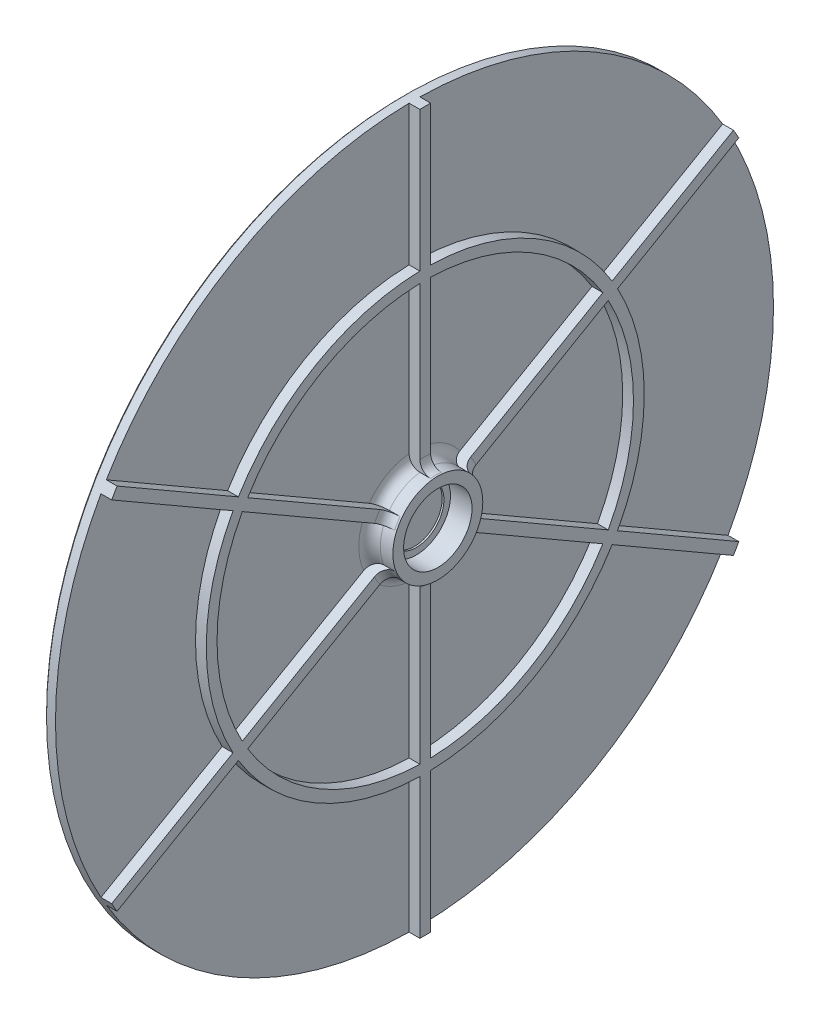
ISO-10303-21;
HEADER;
FILE_DESCRIPTION(('STEP AP214'),'2;1');
FILE_NAME('part.step','',(''),(''),'','','');
FILE_SCHEMA(('AUTOMOTIVE_DESIGN { 1 0 10303 214 1 1 1 1 }'));
ENDSEC;
DATA;
#1=APPLICATION_CONTEXT('core data for automotive mechanical design processes');
#2=APPLICATION_PROTOCOL_DEFINITION('international standard','automotive_design',2000,#1);
#3=PRODUCT_CONTEXT('',#1,'mechanical');
#4=PRODUCT('Part','Part','',(#3));
#5=PRODUCT_RELATED_PRODUCT_CATEGORY('part','',(#4));
#6=PRODUCT_DEFINITION_FORMATION('','',#4);
#7=PRODUCT_DEFINITION_CONTEXT('part definition',#1,'design');
#8=PRODUCT_DEFINITION('design','',#6,#7);
#9=PRODUCT_DEFINITION_SHAPE('','',#8);
#10=(LENGTH_UNIT() NAMED_UNIT(*) SI_UNIT(.MILLI.,.METRE.));
#11=(NAMED_UNIT(*) PLANE_ANGLE_UNIT() SI_UNIT($,.RADIAN.));
#12=(NAMED_UNIT(*) SI_UNIT($,.STERADIAN.) SOLID_ANGLE_UNIT());
#13=UNCERTAINTY_MEASURE_WITH_UNIT(LENGTH_MEASURE(1.E-05),#10,'distance_accuracy_value','');
#14=(GEOMETRIC_REPRESENTATION_CONTEXT(3) GLOBAL_UNCERTAINTY_ASSIGNED_CONTEXT((#13)) GLOBAL_UNIT_ASSIGNED_CONTEXT((#10,
#11,#12)) REPRESENTATION_CONTEXT('',''));
#15=CARTESIAN_POINT('',(0.,0.,0.));
#16=DIRECTION('',(0.,0.,1.));
#17=DIRECTION('',(1.,0.,0.));
#18=AXIS2_PLACEMENT_3D('',#15,#16,#17);
#19=CARTESIAN_POINT('',(3.,100.,0.));
#20=DIRECTION('',(1.,0.,0.));
#21=DIRECTION('',(0.,0.,-1.));
#22=AXIS2_PLACEMENT_3D('',#19,#20,#21);
#23=PLANE('',#22);
#24=CARTESIAN_POINT('',(3.,0.,0.));
#25=DIRECTION('',(1.,0.,0.));
#26=DIRECTION('',(0.,0.,-1.));
#27=AXIS2_PLACEMENT_3D('',#24,#25,#26);
#28=CIRCLE('',#27,100.);
#29=CARTESIAN_POINT('',(3.,-48.6953365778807,-87.3427970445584));
#30=VERTEX_POINT('',#29);
#31=CARTESIAN_POINT('',(3.,48.6953365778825,-87.3427970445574));
#32=VERTEX_POINT('',#31);
#33=EDGE_CURVE('E1036',#30,#32,#28,.T.);
#34=ORIENTED_EDGE('',*,*,#33,.T.);
#35=DIRECTION('',(0.,0.50000000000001,-0.866025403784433));
#36=VECTOR('',#35,1.);
#37=CARTESIAN_POINT('',(3.,4.91838951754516,-11.5189005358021));
#38=LINE('',#37,#36);
#39=CARTESIAN_POINT('',(3.,29.1917391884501,-53.5615754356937));
#40=VERTEX_POINT('',#39);
#41=EDGE_CURVE('E429',#40,#32,#38,.T.);
#42=ORIENTED_EDGE('',*,*,#41,.F.);
#43=CARTESIAN_POINT('',(3.,0.,0.));
#44=DIRECTION('',(1.,0.,0.));
#45=DIRECTION('',(0.,0.,-1.));
#46=AXIS2_PLACEMENT_3D('',#43,#44,#45);
#47=CIRCLE('',#46,61.);
#48=CARTESIAN_POINT('',(3.,-29.191739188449,-53.5615754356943));
#49=VERTEX_POINT('',#48);
#50=EDGE_CURVE('E1062',#49,#40,#47,.T.);
#51=ORIENTED_EDGE('',*,*,#50,.F.);
#52=DIRECTION('',(0.,0.499999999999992,0.866025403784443));
#53=VECTOR('',#52,1.);
#54=CARTESIAN_POINT('',(3.,-4.91838951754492,-11.5189005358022));
#55=LINE('',#54,#53);
#56=EDGE_CURVE('E471',#30,#49,#55,.T.);
#57=ORIENTED_EDGE('',*,*,#56,.F.);
#58=EDGE_LOOP('',(#34,#42,#51,#57));
#59=FACE_BOUND('',#58,.T.);
#60=ADVANCED_FACE('F32',(#59),#23,.T.);
#61=CARTESIAN_POINT('',(3.,31.7898153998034,-52.0615754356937));
#62=VERTEX_POINT('',#61);
#63=CARTESIAN_POINT('',(3.,60.9815545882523,-1.5));
#64=VERTEX_POINT('',#63);
#65=EDGE_CURVE('E640',#62,#64,#47,.T.);
#66=ORIENTED_EDGE('',*,*,#65,.F.);
#67=DIRECTION('',(0.,-0.50000000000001,0.866025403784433));
#68=VECTOR('',#67,1.);
#69=CARTESIAN_POINT('',(3.,7.51646572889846,-10.0189005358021));
#70=LINE('',#69,#68);
#71=CARTESIAN_POINT('',(3.,51.2934127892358,-85.8427970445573));
#72=VERTEX_POINT('',#71);
#73=EDGE_CURVE('E423',#72,#62,#70,.T.);
#74=ORIENTED_EDGE('',*,*,#73,.F.);
#75=CARTESIAN_POINT('',(3.,99.9887493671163,-1.5));
#76=VERTEX_POINT('',#75);
#77=EDGE_CURVE('E645',#72,#76,#28,.T.);
#78=ORIENTED_EDGE('',*,*,#77,.T.);
#79=DIRECTION('',(0.,1.,0.));
#80=VECTOR('',#79,1.);
#81=CARTESIAN_POINT('',(3.,12.4348552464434,-1.5));
#82=LINE('',#81,#80);
#83=EDGE_CURVE('E581',#64,#76,#82,.T.);
#84=ORIENTED_EDGE('',*,*,#83,.F.);
#85=EDGE_LOOP('',(#66,#74,#78,#84));
#86=FACE_BOUND('',#85,.T.);
#87=ADVANCED_FACE('F966',(#86),#23,.T.);
#88=CARTESIAN_POINT('',(3.00000000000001,0.,0.));
#89=DIRECTION('',(1.,0.,0.));
#90=DIRECTION('',(0.,0.,-1.));
#91=AXIS2_PLACEMENT_3D('',#88,#89,#90);
#92=CYLINDRICAL_SURFACE('',#91,61.);
#93=ORIENTED_EDGE('',*,*,#50,.T.);
#94=DIRECTION('',(1.,0.,0.));
#95=VECTOR('',#94,1.);
#96=CARTESIAN_POINT('',(3.00000000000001,29.1917391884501,-53.5615754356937));
#97=LINE('',#96,#95);
#98=CARTESIAN_POINT('',(6.00000000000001,29.1917391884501,-53.5615754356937));
#99=VERTEX_POINT('',#98);
#100=EDGE_CURVE('E456',#40,#99,#97,.T.);
#101=ORIENTED_EDGE('',*,*,#100,.T.);
#102=CARTESIAN_POINT('',(6.00000000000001,0.,0.));
#103=DIRECTION('',(1.,0.,0.));
#104=DIRECTION('',(0.,0.,-1.));
#105=AXIS2_PLACEMENT_3D('',#102,#103,#104);
#106=CIRCLE('',#105,61.);
#107=CARTESIAN_POINT('',(6.00000000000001,-29.191739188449,-53.5615754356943));
#108=VERTEX_POINT('',#107);
#109=EDGE_CURVE('E419',#108,#99,#106,.T.);
#110=ORIENTED_EDGE('',*,*,#109,.F.);
#111=DIRECTION('',(1.,0.,0.));
#112=VECTOR('',#111,1.);
#113=CARTESIAN_POINT('',(3.00000000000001,-29.191739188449,-53.5615754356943));
#114=LINE('',#113,#112);
#115=EDGE_CURVE('E481',#108,#49,#114,.F.);
#116=ORIENTED_EDGE('',*,*,#115,.T.);
#117=EDGE_LOOP('',(#93,#101,#110,#116));
#118=FACE_BOUND('',#117,.T.);
#119=ADVANCED_FACE('F973',(#118),#92,.T.);
#120=CARTESIAN_POINT('',(6.00000000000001,31.7898153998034,-52.0615754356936));
#121=VERTEX_POINT('',#120);
#122=CARTESIAN_POINT('',(6.,60.9815545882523,-1.5));
#123=VERTEX_POINT('',#122);
#124=EDGE_CURVE('E635',#121,#123,#106,.T.);
#125=ORIENTED_EDGE('',*,*,#124,.F.);
#126=DIRECTION('',(1.,0.,0.));
#127=VECTOR('',#126,1.);
#128=CARTESIAN_POINT('',(3.00000000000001,31.7898153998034,-52.0615754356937));
#129=LINE('',#128,#127);
#130=EDGE_CURVE('E451',#121,#62,#129,.F.);
#131=ORIENTED_EDGE('',*,*,#130,.T.);
#132=ORIENTED_EDGE('',*,*,#65,.T.);
#133=DIRECTION('',(1.,0.,0.));
#134=VECTOR('',#133,1.);
#135=CARTESIAN_POINT('',(3.00000000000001,60.9815545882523,-1.5));
#136=LINE('',#135,#134);
#137=EDGE_CURVE('E608',#64,#123,#136,.T.);
#138=ORIENTED_EDGE('',*,*,#137,.T.);
#139=EDGE_LOOP('',(#125,#131,#132,#138));
#140=FACE_BOUND('',#139,.T.);
#141=ADVANCED_FACE('F1026',(#140),#92,.T.);
#142=CARTESIAN_POINT('',(3.00000000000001,0.,0.));
#143=DIRECTION('',(1.,0.,0.));
#144=DIRECTION('',(0.,0.,-1.));
#145=AXIS2_PLACEMENT_3D('',#142,#143,#144);
#146=CYLINDRICAL_SURFACE('',#145,58.);
#147=CARTESIAN_POINT('',(6.00000000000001,0.,0.));
#148=DIRECTION('',(1.,0.,0.));
#149=DIRECTION('',(0.,0.,-1.));
#150=AXIS2_PLACEMENT_3D('',#147,#148,#149);
#151=CIRCLE('',#150,58.);
#152=CARTESIAN_POINT('',(6.00000000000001,-27.6912619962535,-50.9626727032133));
#153=VERTEX_POINT('',#152);
#154=CARTESIAN_POINT('',(6.00000000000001,27.6912619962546,-50.9626727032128));
#155=VERTEX_POINT('',#154);
#156=EDGE_CURVE('E1220',#153,#155,#151,.T.);
#157=ORIENTED_EDGE('',*,*,#156,.T.);
#158=DIRECTION('',(1.,0.,0.));
#159=VECTOR('',#158,1.);
#160=CARTESIAN_POINT('',(3.00000000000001,27.6912619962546,-50.9626727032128));
#161=LINE('',#160,#159);
#162=CARTESIAN_POINT('',(3.00000000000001,27.6912619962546,-50.9626727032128));
#163=VERTEX_POINT('',#162);
#164=EDGE_CURVE('E453',#155,#163,#161,.F.);
#165=ORIENTED_EDGE('',*,*,#164,.T.);
#166=CARTESIAN_POINT('',(3.00000000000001,0.,0.));
#167=DIRECTION('',(1.,0.,0.));
#168=DIRECTION('',(0.,0.,-1.));
#169=AXIS2_PLACEMENT_3D('',#166,#167,#168);
#170=CIRCLE('',#169,58.);
#171=CARTESIAN_POINT('',(3.00000000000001,-27.6912619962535,-50.9626727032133));
#172=VERTEX_POINT('',#171);
#173=EDGE_CURVE('E1198',#172,#163,#170,.T.);
#174=ORIENTED_EDGE('',*,*,#173,.F.);
#175=DIRECTION('',(1.,0.,0.));
#176=VECTOR('',#175,1.);
#177=CARTESIAN_POINT('',(3.00000000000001,-27.6912619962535,-50.9626727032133));
#178=LINE('',#177,#176);
#179=EDGE_CURVE('E479',#172,#153,#178,.T.);
#180=ORIENTED_EDGE('',*,*,#179,.T.);
#181=EDGE_LOOP('',(#157,#165,#174,#180));
#182=FACE_BOUND('',#181,.T.);
#183=ADVANCED_FACE('F1250',(#182),#146,.F.);
#184=CARTESIAN_POINT('',(3.00000000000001,30.2893382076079,-49.4626727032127));
#185=VERTEX_POINT('',#184);
#186=CARTESIAN_POINT('',(3.00000000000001,57.9806002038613,-1.5));
#187=VERTEX_POINT('',#186);
#188=EDGE_CURVE('E626',#185,#187,#170,.T.);
#189=ORIENTED_EDGE('',*,*,#188,.F.);
#190=DIRECTION('',(1.,0.,0.));
#191=VECTOR('',#190,1.);
#192=CARTESIAN_POINT('',(3.00000000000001,30.2893382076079,-49.4626727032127));
#193=LINE('',#192,#191);
#194=CARTESIAN_POINT('',(6.00000000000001,30.2893382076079,-49.4626727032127));
#195=VERTEX_POINT('',#194);
#196=EDGE_CURVE('E431',#185,#195,#193,.T.);
#197=ORIENTED_EDGE('',*,*,#196,.T.);
#198=CARTESIAN_POINT('',(6.00000000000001,57.9806002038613,-1.5));
#199=VERTEX_POINT('',#198);
#200=EDGE_CURVE('E630',#195,#199,#151,.T.);
#201=ORIENTED_EDGE('',*,*,#200,.T.);
#202=DIRECTION('',(1.,0.,0.));
#203=VECTOR('',#202,1.);
#204=CARTESIAN_POINT('',(3.00000000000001,57.9806002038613,-1.5));
#205=LINE('',#204,#203);
#206=EDGE_CURVE('E605',#199,#187,#205,.F.);
#207=ORIENTED_EDGE('',*,*,#206,.T.);
#208=EDGE_LOOP('',(#189,#197,#201,#207));
#209=FACE_BOUND('',#208,.T.);
#210=ADVANCED_FACE('F1214',(#209),#146,.F.);
#211=CARTESIAN_POINT('',(3.00000000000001,58.,0.));
#212=DIRECTION('',(1.,0.,0.));
#213=DIRECTION('',(0.,0.,-1.));
#214=AXIS2_PLACEMENT_3D('',#211,#212,#213);
#215=PLANE('',#214);
#216=CARTESIAN_POINT('',(3.,6.4271450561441,-14.1321417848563));
#217=VERTEX_POINT('',#216);
#218=EDGE_CURVE('E444',#217,#163,#38,.T.);
#219=ORIENTED_EDGE('',*,*,#218,.F.);
#220=CARTESIAN_POINT('',(3.00000000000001,0.,0.));
#221=DIRECTION('',(1.,0.,0.));
#222=DIRECTION('',(0.,0.,-1.));
#223=AXIS2_PLACEMENT_3D('',#220,#221,#222);
#224=CIRCLE('',#223,15.525);
#225=CARTESIAN_POINT('',(3.,-6.4271450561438,-14.1321417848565));
#226=VERTEX_POINT('',#225);
#227=EDGE_CURVE('E938',#217,#226,#224,.F.);
#228=ORIENTED_EDGE('',*,*,#227,.T.);
#229=EDGE_CURVE('E470',#172,#226,#55,.T.);
#230=ORIENTED_EDGE('',*,*,#229,.F.);
#231=ORIENTED_EDGE('',*,*,#173,.T.);
#232=EDGE_LOOP('',(#219,#228,#230,#231));
#233=FACE_BOUND('',#232,.T.);
#234=ADVANCED_FACE('F1256',(#233),#215,.T.);
#235=CARTESIAN_POINT('',(3.,15.4523663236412,-1.5));
#236=VERTEX_POINT('',#235);
#237=EDGE_CURVE('E591',#236,#187,#82,.T.);
#238=ORIENTED_EDGE('',*,*,#237,.F.);
#239=CARTESIAN_POINT('',(3.00000000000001,0.,0.));
#240=DIRECTION('',(1.,0.,0.));
#241=DIRECTION('',(0.,0.,-1.));
#242=AXIS2_PLACEMENT_3D('',#239,#240,#241);
#243=CIRCLE('',#242,15.525);
#244=CARTESIAN_POINT('',(3.,9.0252212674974,-12.6321417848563));
#245=VERTEX_POINT('',#244);
#246=EDGE_CURVE('E926',#236,#245,#243,.F.);
#247=ORIENTED_EDGE('',*,*,#246,.T.);
#248=EDGE_CURVE('E446',#185,#245,#70,.T.);
#249=ORIENTED_EDGE('',*,*,#248,.F.);
#250=ORIENTED_EDGE('',*,*,#188,.T.);
#251=EDGE_LOOP('',(#238,#247,#249,#250));
#252=FACE_BOUND('',#251,.T.);
#253=ADVANCED_FACE('F1017',(#252),#215,.T.);
#254=CARTESIAN_POINT('',(3.00000000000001,0.,0.));
#255=DIRECTION('',(1.,0.,0.));
#256=DIRECTION('',(0.,0.,-1.));
#257=AXIS2_PLACEMENT_3D('',#254,#255,#256);
#258=CYLINDRICAL_SURFACE('',#257,12.525);
#259=CARTESIAN_POINT('',(9.50000000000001,0.,0.));
#260=DIRECTION('',(1.,0.,0.));
#261=DIRECTION('',(0.,0.,-1.));
#262=AXIS2_PLACEMENT_3D('',#259,#260,#261);
#263=CIRCLE('',#262,12.525);
#264=CARTESIAN_POINT('',(9.50000000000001,0.,-12.525));
#265=VERTEX_POINT('',#264);
#266=EDGE_CURVE('E623',#265,#265,#263,.T.);
#267=ORIENTED_EDGE('',*,*,#266,.F.);
#268=EDGE_LOOP('',(#267));
#269=FACE_BOUND('',#268,.T.);
#270=CARTESIAN_POINT('',(6.00000000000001,0.,0.));
#271=DIRECTION('',(1.,0.,0.));
#272=DIRECTION('',(0.,0.,-1.));
#273=AXIS2_PLACEMENT_3D('',#270,#271,#272);
#274=CIRCLE('',#273,12.525);
#275=CARTESIAN_POINT('',(6.,-12.4348552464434,-1.5));
#276=VERTEX_POINT('',#275);
#277=CARTESIAN_POINT('',(6.,-7.51646572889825,-10.0189005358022));
#278=VERTEX_POINT('',#277);
#279=EDGE_CURVE('E710',#276,#278,#274,.T.);
#280=ORIENTED_EDGE('',*,*,#279,.T.);
#281=DIRECTION('',(-1.,0.,0.));
#282=VECTOR('',#281,1.);
#283=CARTESIAN_POINT('',(6.,-7.51646572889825,-10.0189005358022));
#284=LINE('',#283,#282);
#285=CARTESIAN_POINT('',(9.00000000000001,-7.51646572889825,-10.0189005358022));
#286=VERTEX_POINT('',#285);
#287=EDGE_CURVE('E719',#278,#286,#284,.F.);
#288=ORIENTED_EDGE('',*,*,#287,.T.);
#289=CARTESIAN_POINT('',(9.00000000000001,0.,0.));
#290=DIRECTION('',(1.,0.,0.));
#291=DIRECTION('',(0.,0.,-1.));
#292=AXIS2_PLACEMENT_3D('',#289,#290,#291);
#293=CIRCLE('',#292,12.525);
#294=CARTESIAN_POINT('',(9.00000000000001,-4.91838951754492,-11.5189005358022));
#295=VERTEX_POINT('',#294);
#296=EDGE_CURVE('E716',#286,#295,#293,.T.);
#297=ORIENTED_EDGE('',*,*,#296,.T.);
#298=DIRECTION('',(-1.,0.,0.));
#299=VECTOR('',#298,1.);
#300=CARTESIAN_POINT('',(6.,-4.91838951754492,-11.5189005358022));
#301=LINE('',#300,#299);
#302=CARTESIAN_POINT('',(6.,-4.91838951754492,-11.5189005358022));
#303=VERTEX_POINT('',#302);
#304=EDGE_CURVE('E713',#295,#303,#301,.T.);
#305=ORIENTED_EDGE('',*,*,#304,.T.);
#306=CARTESIAN_POINT('',(6.00000000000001,0.,0.));
#307=DIRECTION('',(1.,0.,0.));
#308=DIRECTION('',(0.,0.,-1.));
#309=AXIS2_PLACEMENT_3D('',#306,#307,#308);
#310=CIRCLE('',#309,12.525);
#311=CARTESIAN_POINT('',(6.,4.91838951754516,-11.5189005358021));
#312=VERTEX_POINT('',#311);
#313=EDGE_CURVE('E707',#303,#312,#310,.T.);
#314=ORIENTED_EDGE('',*,*,#313,.T.);
#315=DIRECTION('',(-1.,0.,0.));
#316=VECTOR('',#315,1.);
#317=CARTESIAN_POINT('',(6.,4.91838951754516,-11.5189005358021));
#318=LINE('',#317,#316);
#319=CARTESIAN_POINT('',(9.00000000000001,4.91838951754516,-11.5189005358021));
#320=VERTEX_POINT('',#319);
#321=EDGE_CURVE('E704',#312,#320,#318,.F.);
#322=ORIENTED_EDGE('',*,*,#321,.T.);
#323=CARTESIAN_POINT('',(9.00000000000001,0.,0.));
#324=DIRECTION('',(1.,0.,0.));
#325=DIRECTION('',(0.,0.,-1.));
#326=AXIS2_PLACEMENT_3D('',#323,#324,#325);
#327=CIRCLE('',#326,12.525);
#328=CARTESIAN_POINT('',(9.00000000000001,7.51646572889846,-10.0189005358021));
#329=VERTEX_POINT('',#328);
#330=EDGE_CURVE('E701',#320,#329,#327,.T.);
#331=ORIENTED_EDGE('',*,*,#330,.T.);
#332=DIRECTION('',(-1.,0.,0.));
#333=VECTOR('',#332,1.);
#334=CARTESIAN_POINT('',(6.,7.51646572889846,-10.0189005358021));
#335=LINE('',#334,#333);
#336=CARTESIAN_POINT('',(6.,7.51646572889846,-10.0189005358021));
#337=VERTEX_POINT('',#336);
#338=EDGE_CURVE('E698',#329,#337,#335,.T.);
#339=ORIENTED_EDGE('',*,*,#338,.T.);
#340=CARTESIAN_POINT('',(6.00000000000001,0.,0.));
#341=DIRECTION('',(1.,0.,0.));
#342=DIRECTION('',(0.,0.,-1.));
#343=AXIS2_PLACEMENT_3D('',#340,#341,#342);
#344=CIRCLE('',#343,12.525);
#345=CARTESIAN_POINT('',(6.,12.4348552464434,-1.5));
#346=VERTEX_POINT('',#345);
#347=EDGE_CURVE('E692',#337,#346,#344,.T.);
#348=ORIENTED_EDGE('',*,*,#347,.T.);
#349=DIRECTION('',(-1.,0.,0.));
#350=VECTOR('',#349,1.);
#351=CARTESIAN_POINT('',(6.,12.4348552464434,-1.5));
#352=LINE('',#351,#350);
#353=CARTESIAN_POINT('',(9.00000000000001,12.4348552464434,-1.5));
#354=VERTEX_POINT('',#353);
#355=EDGE_CURVE('E689',#346,#354,#352,.F.);
#356=ORIENTED_EDGE('',*,*,#355,.T.);
#357=CARTESIAN_POINT('',(9.00000000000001,0.,0.));
#358=DIRECTION('',(1.,0.,0.));
#359=DIRECTION('',(0.,0.,-1.));
#360=AXIS2_PLACEMENT_3D('',#357,#358,#359);
#361=CIRCLE('',#360,12.525);
#362=CARTESIAN_POINT('',(9.00000000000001,12.4348552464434,1.5));
#363=VERTEX_POINT('',#362);
#364=EDGE_CURVE('E686',#354,#363,#361,.T.);
#365=ORIENTED_EDGE('',*,*,#364,.T.);
#366=DIRECTION('',(-1.,0.,0.));
#367=VECTOR('',#366,1.);
#368=CARTESIAN_POINT('',(6.,12.4348552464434,1.5));
#369=LINE('',#368,#367);
#370=CARTESIAN_POINT('',(6.,12.4348552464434,1.5));
#371=VERTEX_POINT('',#370);
#372=EDGE_CURVE('E683',#363,#371,#369,.T.);
#373=ORIENTED_EDGE('',*,*,#372,.T.);
#374=CARTESIAN_POINT('',(6.00000000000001,0.,0.));
#375=DIRECTION('',(1.,0.,0.));
#376=DIRECTION('',(0.,0.,-1.));
#377=AXIS2_PLACEMENT_3D('',#374,#375,#376);
#378=CIRCLE('',#377,12.525);
#379=CARTESIAN_POINT('',(6.,7.51646572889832,10.0189005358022));
#380=VERTEX_POINT('',#379);
#381=EDGE_CURVE('E677',#371,#380,#378,.T.);
#382=ORIENTED_EDGE('',*,*,#381,.T.);
#383=DIRECTION('',(-1.,0.,0.));
#384=VECTOR('',#383,1.);
#385=CARTESIAN_POINT('',(6.,7.51646572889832,10.0189005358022));
#386=LINE('',#385,#384);
#387=CARTESIAN_POINT('',(9.00000000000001,7.51646572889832,10.0189005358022));
#388=VERTEX_POINT('',#387);
#389=EDGE_CURVE('E674',#380,#388,#386,.F.);
#390=ORIENTED_EDGE('',*,*,#389,.T.);
#391=CARTESIAN_POINT('',(9.00000000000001,0.,0.));
#392=DIRECTION('',(1.,0.,0.));
#393=DIRECTION('',(0.,0.,-1.));
#394=AXIS2_PLACEMENT_3D('',#391,#392,#393);
#395=CIRCLE('',#394,12.525);
#396=CARTESIAN_POINT('',(9.00000000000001,4.918389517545,11.5189005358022));
#397=VERTEX_POINT('',#396);
#398=EDGE_CURVE('E671',#388,#397,#395,.T.);
#399=ORIENTED_EDGE('',*,*,#398,.T.);
#400=DIRECTION('',(-1.,0.,0.));
#401=VECTOR('',#400,1.);
#402=CARTESIAN_POINT('',(6.,4.918389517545,11.5189005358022));
#403=LINE('',#402,#401);
#404=CARTESIAN_POINT('',(6.,4.918389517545,11.5189005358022));
#405=VERTEX_POINT('',#404);
#406=EDGE_CURVE('E668',#397,#405,#403,.T.);
#407=ORIENTED_EDGE('',*,*,#406,.T.);
#408=CARTESIAN_POINT('',(6.00000000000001,0.,0.));
#409=DIRECTION('',(1.,0.,0.));
#410=DIRECTION('',(0.,0.,-1.));
#411=AXIS2_PLACEMENT_3D('',#408,#409,#410);
#412=CIRCLE('',#411,12.525);
#413=CARTESIAN_POINT('',(6.,-4.91838951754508,11.5189005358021));
#414=VERTEX_POINT('',#413);
#415=EDGE_CURVE('E662',#405,#414,#412,.T.);
#416=ORIENTED_EDGE('',*,*,#415,.T.);
#417=DIRECTION('',(-1.,0.,0.));
#418=VECTOR('',#417,1.);
#419=CARTESIAN_POINT('',(6.,-4.91838951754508,11.5189005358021));
#420=LINE('',#419,#418);
#421=CARTESIAN_POINT('',(9.00000000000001,-4.91838951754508,11.5189005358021));
#422=VERTEX_POINT('',#421);
#423=EDGE_CURVE('E656',#414,#422,#420,.F.);
#424=ORIENTED_EDGE('',*,*,#423,.T.);
#425=CARTESIAN_POINT('',(9.00000000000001,0.,0.));
#426=DIRECTION('',(1.,0.,0.));
#427=DIRECTION('',(0.,0.,-1.));
#428=AXIS2_PLACEMENT_3D('',#425,#426,#427);
#429=CIRCLE('',#428,12.525);
#430=CARTESIAN_POINT('',(9.00000000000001,-7.51646572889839,10.0189005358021));
#431=VERTEX_POINT('',#430);
#432=EDGE_CURVE('E653',#422,#431,#429,.T.);
#433=ORIENTED_EDGE('',*,*,#432,.T.);
#434=DIRECTION('',(-1.,0.,0.));
#435=VECTOR('',#434,1.);
#436=CARTESIAN_POINT('',(6.,-7.51646572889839,10.0189005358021));
#437=LINE('',#436,#435);
#438=CARTESIAN_POINT('',(6.,-7.51646572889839,10.0189005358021));
#439=VERTEX_POINT('',#438);
#440=EDGE_CURVE('E649',#431,#439,#437,.T.);
#441=ORIENTED_EDGE('',*,*,#440,.T.);
#442=CARTESIAN_POINT('',(6.00000000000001,0.,0.));
#443=DIRECTION('',(1.,0.,0.));
#444=DIRECTION('',(0.,0.,-1.));
#445=AXIS2_PLACEMENT_3D('',#442,#443,#444);
#446=CIRCLE('',#445,12.525);
#447=CARTESIAN_POINT('',(6.,-12.4348552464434,1.5));
#448=VERTEX_POINT('',#447);
#449=EDGE_CURVE('E659',#439,#448,#446,.T.);
#450=ORIENTED_EDGE('',*,*,#449,.T.);
#451=DIRECTION('',(-1.,0.,0.));
#452=VECTOR('',#451,1.);
#453=CARTESIAN_POINT('',(6.,-12.4348552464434,1.5));
#454=LINE('',#453,#452);
#455=CARTESIAN_POINT('',(9.00000000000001,-12.4348552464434,1.5));
#456=VERTEX_POINT('',#455);
#457=EDGE_CURVE('E665',#448,#456,#454,.F.);
#458=ORIENTED_EDGE('',*,*,#457,.T.);
#459=CARTESIAN_POINT('',(9.00000000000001,0.,0.));
#460=DIRECTION('',(1.,0.,0.));
#461=DIRECTION('',(0.,0.,-1.));
#462=AXIS2_PLACEMENT_3D('',#459,#460,#461);
#463=CIRCLE('',#462,12.525);
#464=CARTESIAN_POINT('',(9.00000000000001,-12.4348552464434,-1.5));
#465=VERTEX_POINT('',#464);
#466=EDGE_CURVE('E680',#456,#465,#463,.T.);
#467=ORIENTED_EDGE('',*,*,#466,.T.);
#468=DIRECTION('',(-1.,0.,0.));
#469=VECTOR('',#468,1.);
#470=CARTESIAN_POINT('',(6.,-12.4348552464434,-1.5));
#471=LINE('',#470,#469);
#472=EDGE_CURVE('E695',#465,#276,#471,.T.);
#473=ORIENTED_EDGE('',*,*,#472,.T.);
#474=EDGE_LOOP('',(#280,#288,#297,#305,#314,#322,#331,#339,#348,#356,#365,#373,#382,#390,#399,
#407,#416,#424,#433,#441,#450,#458,#467,#473));
#475=FACE_BOUND('',#474,.T.);
#476=ADVANCED_FACE('F1019',(#269,#475),#258,.T.);
#477=CARTESIAN_POINT('',(3.,-99.9887493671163,-1.5));
#478=VERTEX_POINT('',#477);
#479=CARTESIAN_POINT('',(3.,-51.293412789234,-85.8427970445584));
#480=VERTEX_POINT('',#479);
#481=EDGE_CURVE('E1030',#478,#480,#28,.T.);
#482=ORIENTED_EDGE('',*,*,#481,.T.);
#483=DIRECTION('',(0.,-0.499999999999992,-0.866025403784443));
#484=VECTOR('',#483,1.);
#485=CARTESIAN_POINT('',(3.,-7.51646572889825,-10.0189005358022));
#486=LINE('',#485,#484);
#487=CARTESIAN_POINT('',(3.,-31.7898153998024,-52.0615754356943));
#488=VERTEX_POINT('',#487);
#489=EDGE_CURVE('E458',#488,#480,#486,.T.);
#490=ORIENTED_EDGE('',*,*,#489,.F.);
#491=CARTESIAN_POINT('',(3.,-60.9815545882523,-1.5));
#492=VERTEX_POINT('',#491);
#493=EDGE_CURVE('E1064',#492,#488,#47,.T.);
#494=ORIENTED_EDGE('',*,*,#493,.F.);
#495=DIRECTION('',(0.,1.,0.));
#496=VECTOR('',#495,1.);
#497=CARTESIAN_POINT('',(3.,-12.4348552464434,-1.5));
#498=LINE('',#497,#496);
#499=EDGE_CURVE('E502',#478,#492,#498,.T.);
#500=ORIENTED_EDGE('',*,*,#499,.F.);
#501=EDGE_LOOP('',(#482,#490,#494,#500));
#502=FACE_BOUND('',#501,.T.);
#503=ADVANCED_FACE('F975',(#502),#23,.T.);
#504=ORIENTED_EDGE('',*,*,#493,.T.);
#505=DIRECTION('',(1.,0.,0.));
#506=VECTOR('',#505,1.);
#507=CARTESIAN_POINT('',(3.00000000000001,-31.7898153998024,-52.0615754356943));
#508=LINE('',#507,#506);
#509=CARTESIAN_POINT('',(6.00000000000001,-31.7898153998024,-52.0615754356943));
#510=VERTEX_POINT('',#509);
#511=EDGE_CURVE('E486',#488,#510,#508,.T.);
#512=ORIENTED_EDGE('',*,*,#511,.T.);
#513=CARTESIAN_POINT('',(6.00000000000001,-60.9815545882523,-1.5));
#514=VERTEX_POINT('',#513);
#515=EDGE_CURVE('E1045',#514,#510,#106,.T.);
#516=ORIENTED_EDGE('',*,*,#515,.F.);
#517=DIRECTION('',(1.,0.,0.));
#518=VECTOR('',#517,1.);
#519=CARTESIAN_POINT('',(3.00000000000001,-60.9815545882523,-1.5));
#520=LINE('',#519,#518);
#521=EDGE_CURVE('E512',#514,#492,#520,.F.);
#522=ORIENTED_EDGE('',*,*,#521,.T.);
#523=EDGE_LOOP('',(#504,#512,#516,#522));
#524=FACE_BOUND('',#523,.T.);
#525=ADVANCED_FACE('F1014',(#524),#92,.T.);
#526=CARTESIAN_POINT('',(6.00000000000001,-57.9806002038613,-1.5));
#527=VERTEX_POINT('',#526);
#528=CARTESIAN_POINT('',(6.00000000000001,-30.2893382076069,-49.4626727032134));
#529=VERTEX_POINT('',#528);
#530=EDGE_CURVE('E1222',#527,#529,#151,.T.);
#531=ORIENTED_EDGE('',*,*,#530,.T.);
#532=DIRECTION('',(1.,0.,0.));
#533=VECTOR('',#532,1.);
#534=CARTESIAN_POINT('',(3.00000000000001,-30.2893382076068,-49.4626727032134));
#535=LINE('',#534,#533);
#536=CARTESIAN_POINT('',(3.00000000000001,-30.2893382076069,-49.4626727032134));
#537=VERTEX_POINT('',#536);
#538=EDGE_CURVE('E483',#529,#537,#535,.F.);
#539=ORIENTED_EDGE('',*,*,#538,.T.);
#540=CARTESIAN_POINT('',(3.00000000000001,-57.9806002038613,-1.5));
#541=VERTEX_POINT('',#540);
#542=EDGE_CURVE('E1195',#541,#537,#170,.T.);
#543=ORIENTED_EDGE('',*,*,#542,.F.);
#544=DIRECTION('',(1.,0.,0.));
#545=VECTOR('',#544,1.);
#546=CARTESIAN_POINT('',(3.00000000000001,-57.9806002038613,-1.5));
#547=LINE('',#546,#545);
#548=EDGE_CURVE('E510',#541,#527,#547,.T.);
#549=ORIENTED_EDGE('',*,*,#548,.T.);
#550=EDGE_LOOP('',(#531,#539,#543,#549));
#551=FACE_BOUND('',#550,.T.);
#552=ADVANCED_FACE('F1015',(#551),#146,.F.);
#553=CARTESIAN_POINT('',(3.,-9.02522126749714,-12.6321417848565));
#554=VERTEX_POINT('',#553);
#555=EDGE_CURVE('E468',#554,#537,#486,.T.);
#556=ORIENTED_EDGE('',*,*,#555,.F.);
#557=CARTESIAN_POINT('',(3.00000000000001,0.,0.));
#558=DIRECTION('',(1.,0.,0.));
#559=DIRECTION('',(0.,0.,-1.));
#560=AXIS2_PLACEMENT_3D('',#557,#558,#559);
#561=CIRCLE('',#560,15.525);
#562=CARTESIAN_POINT('',(3.,-15.4523663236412,-1.5));
#563=VERTEX_POINT('',#562);
#564=EDGE_CURVE('E829',#554,#563,#561,.F.);
#565=ORIENTED_EDGE('',*,*,#564,.T.);
#566=EDGE_CURVE('E501',#541,#563,#498,.T.);
#567=ORIENTED_EDGE('',*,*,#566,.F.);
#568=ORIENTED_EDGE('',*,*,#542,.T.);
#569=EDGE_LOOP('',(#556,#565,#567,#568));
#570=FACE_BOUND('',#569,.T.);
#571=ADVANCED_FACE('F1006',(#570),#215,.T.);
#572=CARTESIAN_POINT('',(3.,-51.2934127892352,85.8427970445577));
#573=VERTEX_POINT('',#572);
#574=CARTESIAN_POINT('',(3.,-99.9887493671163,1.5));
#575=VERTEX_POINT('',#574);
#576=EDGE_CURVE('E1035',#573,#575,#28,.T.);
#577=ORIENTED_EDGE('',*,*,#576,.T.);
#578=DIRECTION('',(0.,-1.,0.));
#579=VECTOR('',#578,1.);
#580=CARTESIAN_POINT('',(3.,-12.4348552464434,1.5));
#581=LINE('',#580,#579);
#582=CARTESIAN_POINT('',(3.,-60.9815545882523,1.5));
#583=VERTEX_POINT('',#582);
#584=EDGE_CURVE('E488',#583,#575,#581,.T.);
#585=ORIENTED_EDGE('',*,*,#584,.F.);
#586=CARTESIAN_POINT('',(3.,-31.7898153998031,52.0615754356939));
#587=VERTEX_POINT('',#586);
#588=EDGE_CURVE('E1067',#587,#583,#47,.T.);
#589=ORIENTED_EDGE('',*,*,#588,.F.);
#590=DIRECTION('',(0.,0.500000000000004,-0.866025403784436));
#591=VECTOR('',#590,1.);
#592=CARTESIAN_POINT('',(3.,-7.51646572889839,10.0189005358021));
#593=LINE('',#592,#591);
#594=EDGE_CURVE('E533',#573,#587,#593,.T.);
#595=ORIENTED_EDGE('',*,*,#594,.F.);
#596=EDGE_LOOP('',(#577,#585,#589,#595));
#597=FACE_BOUND('',#596,.T.);
#598=ADVANCED_FACE('F997',(#597),#23,.T.);
#599=ORIENTED_EDGE('',*,*,#588,.T.);
#600=DIRECTION('',(1.,0.,0.));
#601=VECTOR('',#600,1.);
#602=CARTESIAN_POINT('',(3.00000000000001,-60.9815545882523,1.5));
#603=LINE('',#602,#601);
#604=CARTESIAN_POINT('',(6.00000000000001,-60.9815545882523,1.5));
#605=VERTEX_POINT('',#604);
#606=EDGE_CURVE('E517',#583,#605,#603,.T.);
#607=ORIENTED_EDGE('',*,*,#606,.T.);
#608=CARTESIAN_POINT('',(6.00000000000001,-31.7898153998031,52.0615754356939));
#609=VERTEX_POINT('',#608);
#610=EDGE_CURVE('E1048',#609,#605,#106,.T.);
#611=ORIENTED_EDGE('',*,*,#610,.F.);
#612=DIRECTION('',(1.,0.,0.));
#613=VECTOR('',#612,1.);
#614=CARTESIAN_POINT('',(3.00000000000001,-31.7898153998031,52.0615754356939));
#615=LINE('',#614,#613);
#616=EDGE_CURVE('E543',#609,#587,#615,.F.);
#617=ORIENTED_EDGE('',*,*,#616,.T.);
#618=EDGE_LOOP('',(#599,#607,#611,#617));
#619=FACE_BOUND('',#618,.T.);
#620=ADVANCED_FACE('F1003',(#619),#92,.T.);
#621=CARTESIAN_POINT('',(6.00000000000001,-30.2893382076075,49.4626727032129));
#622=VERTEX_POINT('',#621);
#623=CARTESIAN_POINT('',(6.00000000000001,-57.9806002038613,1.5));
#624=VERTEX_POINT('',#623);
#625=EDGE_CURVE('E1128',#622,#624,#151,.T.);
#626=ORIENTED_EDGE('',*,*,#625,.T.);
#627=DIRECTION('',(1.,0.,0.));
#628=VECTOR('',#627,1.);
#629=CARTESIAN_POINT('',(3.00000000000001,-57.9806002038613,1.5));
#630=LINE('',#629,#628);
#631=CARTESIAN_POINT('',(3.00000000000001,-57.9806002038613,1.5));
#632=VERTEX_POINT('',#631);
#633=EDGE_CURVE('E514',#624,#632,#630,.F.);
#634=ORIENTED_EDGE('',*,*,#633,.T.);
#635=CARTESIAN_POINT('',(3.00000000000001,-30.2893382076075,49.462672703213));
#636=VERTEX_POINT('',#635);
#637=EDGE_CURVE('E1194',#636,#632,#170,.T.);
#638=ORIENTED_EDGE('',*,*,#637,.F.);
#639=DIRECTION('',(1.,0.,0.));
#640=VECTOR('',#639,1.);
#641=CARTESIAN_POINT('',(3.00000000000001,-30.2893382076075,49.4626727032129));
#642=LINE('',#641,#640);
#643=EDGE_CURVE('E541',#636,#622,#642,.T.);
#644=ORIENTED_EDGE('',*,*,#643,.T.);
#645=EDGE_LOOP('',(#626,#634,#638,#644));
#646=FACE_BOUND('',#645,.T.);
#647=ADVANCED_FACE('F1004',(#646),#146,.F.);
#648=CARTESIAN_POINT('',(3.,-15.4523663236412,1.5));
#649=VERTEX_POINT('',#648);
#650=EDGE_CURVE('E499',#649,#632,#581,.T.);
#651=ORIENTED_EDGE('',*,*,#650,.F.);
#652=CARTESIAN_POINT('',(3.00000000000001,0.,0.));
#653=DIRECTION('',(1.,0.,0.));
#654=DIRECTION('',(0.,0.,-1.));
#655=AXIS2_PLACEMENT_3D('',#652,#653,#654);
#656=CIRCLE('',#655,15.525);
#657=CARTESIAN_POINT('',(3.,-9.02522126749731,12.6321417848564));
#658=VERTEX_POINT('',#657);
#659=EDGE_CURVE('E805',#649,#658,#656,.F.);
#660=ORIENTED_EDGE('',*,*,#659,.T.);
#661=EDGE_CURVE('E532',#636,#658,#593,.T.);
#662=ORIENTED_EDGE('',*,*,#661,.F.);
#663=ORIENTED_EDGE('',*,*,#637,.T.);
#664=EDGE_LOOP('',(#651,#660,#662,#663));
#665=FACE_BOUND('',#664,.T.);
#666=ADVANCED_FACE('F994',(#665),#215,.T.);
#667=CARTESIAN_POINT('',(3.,48.6953365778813,87.3427970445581));
#668=VERTEX_POINT('',#667);
#669=CARTESIAN_POINT('',(3.,-48.6953365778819,87.3427970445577));
#670=VERTEX_POINT('',#669);
#671=EDGE_CURVE('E650',#668,#670,#28,.T.);
#672=ORIENTED_EDGE('',*,*,#671,.T.);
#673=DIRECTION('',(0.,-0.500000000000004,0.866025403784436));
#674=VECTOR('',#673,1.);
#675=CARTESIAN_POINT('',(3.,-4.91838951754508,11.5189005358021));
#676=LINE('',#675,#674);
#677=CARTESIAN_POINT('',(3.,-29.1917391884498,53.5615754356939));
#678=VERTEX_POINT('',#677);
#679=EDGE_CURVE('E519',#678,#670,#676,.T.);
#680=ORIENTED_EDGE('',*,*,#679,.F.);
#681=CARTESIAN_POINT('',(3.,29.1917391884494,53.5615754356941));
#682=VERTEX_POINT('',#681);
#683=EDGE_CURVE('E646',#682,#678,#47,.T.);
#684=ORIENTED_EDGE('',*,*,#683,.F.);
#685=DIRECTION('',(0.,-0.499999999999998,-0.86602540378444));
#686=VECTOR('',#685,1.);
#687=CARTESIAN_POINT('',(3.,4.918389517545,11.5189005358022));
#688=LINE('',#687,#686);
#689=EDGE_CURVE('E564',#668,#682,#688,.T.);
#690=ORIENTED_EDGE('',*,*,#689,.F.);
#691=EDGE_LOOP('',(#672,#680,#684,#690));
#692=FACE_BOUND('',#691,.T.);
#693=ADVANCED_FACE('F982',(#692),#23,.T.);
#694=ORIENTED_EDGE('',*,*,#683,.T.);
#695=DIRECTION('',(1.,0.,0.));
#696=VECTOR('',#695,1.);
#697=CARTESIAN_POINT('',(3.00000000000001,-29.1917391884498,53.5615754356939));
#698=LINE('',#697,#696);
#699=CARTESIAN_POINT('',(6.00000000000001,-29.1917391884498,53.5615754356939));
#700=VERTEX_POINT('',#699);
#701=EDGE_CURVE('E548',#678,#700,#698,.T.);
#702=ORIENTED_EDGE('',*,*,#701,.T.);
#703=CARTESIAN_POINT('',(6.00000000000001,29.1917391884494,53.5615754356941));
#704=VERTEX_POINT('',#703);
#705=EDGE_CURVE('E641',#704,#700,#106,.T.);
#706=ORIENTED_EDGE('',*,*,#705,.F.);
#707=DIRECTION('',(1.,0.,0.));
#708=VECTOR('',#707,1.);
#709=CARTESIAN_POINT('',(3.00000000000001,29.1917391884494,53.5615754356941));
#710=LINE('',#709,#708);
#711=EDGE_CURVE('E574',#704,#682,#710,.F.);
#712=ORIENTED_EDGE('',*,*,#711,.T.);
#713=EDGE_LOOP('',(#694,#702,#706,#712));
#714=FACE_BOUND('',#713,.T.);
#715=ADVANCED_FACE('F989',(#714),#92,.T.);
#716=CARTESIAN_POINT('',(6.00000000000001,27.6912619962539,50.9626727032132));
#717=VERTEX_POINT('',#716);
#718=CARTESIAN_POINT('',(6.00000000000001,-27.6912619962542,50.962672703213));
#719=VERTEX_POINT('',#718);
#720=EDGE_CURVE('E636',#717,#719,#151,.T.);
#721=ORIENTED_EDGE('',*,*,#720,.T.);
#722=DIRECTION('',(1.,0.,0.));
#723=VECTOR('',#722,1.);
#724=CARTESIAN_POINT('',(3.00000000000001,-27.6912619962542,50.9626727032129));
#725=LINE('',#724,#723);
#726=CARTESIAN_POINT('',(3.00000000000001,-27.6912619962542,50.962672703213));
#727=VERTEX_POINT('',#726);
#728=EDGE_CURVE('E545',#719,#727,#725,.F.);
#729=ORIENTED_EDGE('',*,*,#728,.T.);
#730=CARTESIAN_POINT('',(3.00000000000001,27.6912619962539,50.9626727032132));
#731=VERTEX_POINT('',#730);
#732=EDGE_CURVE('E631',#731,#727,#170,.T.);
#733=ORIENTED_EDGE('',*,*,#732,.F.);
#734=DIRECTION('',(1.,0.,0.));
#735=VECTOR('',#734,1.);
#736=CARTESIAN_POINT('',(3.00000000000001,27.6912619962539,50.9626727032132));
#737=LINE('',#736,#735);
#738=EDGE_CURVE('E572',#731,#717,#737,.T.);
#739=ORIENTED_EDGE('',*,*,#738,.T.);
#740=EDGE_LOOP('',(#721,#729,#733,#739));
#741=FACE_BOUND('',#740,.T.);
#742=ADVANCED_FACE('F990',(#741),#146,.F.);
#743=CARTESIAN_POINT('',(3.,-6.427145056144,14.1321417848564));
#744=VERTEX_POINT('',#743);
#745=EDGE_CURVE('E530',#744,#727,#676,.T.);
#746=ORIENTED_EDGE('',*,*,#745,.F.);
#747=CARTESIAN_POINT('',(3.00000000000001,0.,0.));
#748=DIRECTION('',(1.,0.,0.));
#749=DIRECTION('',(0.,0.,-1.));
#750=AXIS2_PLACEMENT_3D('',#747,#748,#749);
#751=CIRCLE('',#750,15.525);
#752=CARTESIAN_POINT('',(3.,6.4271450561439,14.1321417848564));
#753=VERTEX_POINT('',#752);
#754=EDGE_CURVE('E728',#744,#753,#751,.F.);
#755=ORIENTED_EDGE('',*,*,#754,.T.);
#756=EDGE_CURVE('E563',#731,#753,#688,.T.);
#757=ORIENTED_EDGE('',*,*,#756,.F.);
#758=ORIENTED_EDGE('',*,*,#732,.T.);
#759=EDGE_LOOP('',(#746,#755,#757,#758));
#760=FACE_BOUND('',#759,.T.);
#761=ADVANCED_FACE('F980',(#760),#215,.T.);
#762=CARTESIAN_POINT('',(3.,99.9887493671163,1.5));
#763=VERTEX_POINT('',#762);
#764=CARTESIAN_POINT('',(3.,51.2934127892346,85.8427970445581));
#765=VERTEX_POINT('',#764);
#766=EDGE_CURVE('E647',#763,#765,#28,.T.);
#767=ORIENTED_EDGE('',*,*,#766,.T.);
#768=DIRECTION('',(0.,0.499999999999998,0.86602540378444));
#769=VECTOR('',#768,1.);
#770=CARTESIAN_POINT('',(3.,7.51646572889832,10.0189005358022));
#771=LINE('',#770,#769);
#772=CARTESIAN_POINT('',(3.,31.7898153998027,52.0615754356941));
#773=VERTEX_POINT('',#772);
#774=EDGE_CURVE('E550',#773,#765,#771,.T.);
#775=ORIENTED_EDGE('',*,*,#774,.F.);
#776=CARTESIAN_POINT('',(3.,60.9815545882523,1.5));
#777=VERTEX_POINT('',#776);
#778=EDGE_CURVE('E642',#777,#773,#47,.T.);
#779=ORIENTED_EDGE('',*,*,#778,.F.);
#780=DIRECTION('',(0.,-1.,0.));
#781=VECTOR('',#780,1.);
#782=CARTESIAN_POINT('',(3.,12.4348552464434,1.5));
#783=LINE('',#782,#781);
#784=EDGE_CURVE('E594',#763,#777,#783,.T.);
#785=ORIENTED_EDGE('',*,*,#784,.F.);
#786=EDGE_LOOP('',(#767,#775,#779,#785));
#787=FACE_BOUND('',#786,.T.);
#788=ADVANCED_FACE('F969',(#787),#23,.T.);
#789=ORIENTED_EDGE('',*,*,#778,.T.);
#790=DIRECTION('',(1.,0.,0.));
#791=VECTOR('',#790,1.);
#792=CARTESIAN_POINT('',(3.00000000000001,31.7898153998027,52.0615754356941));
#793=LINE('',#792,#791);
#794=CARTESIAN_POINT('',(6.00000000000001,31.7898153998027,52.0615754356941));
#795=VERTEX_POINT('',#794);
#796=EDGE_CURVE('E579',#773,#795,#793,.T.);
#797=ORIENTED_EDGE('',*,*,#796,.T.);
#798=CARTESIAN_POINT('',(6.00000000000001,60.9815545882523,1.5));
#799=VERTEX_POINT('',#798);
#800=EDGE_CURVE('E637',#799,#795,#106,.T.);
#801=ORIENTED_EDGE('',*,*,#800,.F.);
#802=DIRECTION('',(1.,0.,0.));
#803=VECTOR('',#802,1.);
#804=CARTESIAN_POINT('',(3.00000000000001,60.9815545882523,1.5));
#805=LINE('',#804,#803);
#806=EDGE_CURVE('E602',#799,#777,#805,.F.);
#807=ORIENTED_EDGE('',*,*,#806,.T.);
#808=EDGE_LOOP('',(#789,#797,#801,#807));
#809=FACE_BOUND('',#808,.T.);
#810=ADVANCED_FACE('F979',(#809),#92,.T.);
#811=CARTESIAN_POINT('',(6.00000000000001,57.9806002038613,1.5));
#812=VERTEX_POINT('',#811);
#813=CARTESIAN_POINT('',(6.00000000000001,30.2893382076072,49.4626727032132));
#814=VERTEX_POINT('',#813);
#815=EDGE_CURVE('E632',#812,#814,#151,.T.);
#816=ORIENTED_EDGE('',*,*,#815,.T.);
#817=DIRECTION('',(1.,0.,0.));
#818=VECTOR('',#817,1.);
#819=CARTESIAN_POINT('',(3.00000000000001,30.2893382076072,49.4626727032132));
#820=LINE('',#819,#818);
#821=CARTESIAN_POINT('',(3.00000000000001,30.2893382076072,49.4626727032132));
#822=VERTEX_POINT('',#821);
#823=EDGE_CURVE('E576',#814,#822,#820,.F.);
#824=ORIENTED_EDGE('',*,*,#823,.T.);
#825=CARTESIAN_POINT('',(3.00000000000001,57.9806002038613,1.5));
#826=VERTEX_POINT('',#825);
#827=EDGE_CURVE('E627',#826,#822,#170,.T.);
#828=ORIENTED_EDGE('',*,*,#827,.F.);
#829=DIRECTION('',(1.,0.,0.));
#830=VECTOR('',#829,1.);
#831=CARTESIAN_POINT('',(3.00000000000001,57.9806002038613,1.5));
#832=LINE('',#831,#830);
#833=EDGE_CURVE('E600',#826,#812,#832,.T.);
#834=ORIENTED_EDGE('',*,*,#833,.T.);
#835=EDGE_LOOP('',(#816,#824,#828,#834));
#836=FACE_BOUND('',#835,.T.);
#837=ADVANCED_FACE('F987',(#836),#146,.F.);
#838=CARTESIAN_POINT('',(3.,9.02522126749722,12.6321417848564));
#839=VERTEX_POINT('',#838);
#840=EDGE_CURVE('E561',#839,#822,#771,.T.);
#841=ORIENTED_EDGE('',*,*,#840,.F.);
#842=CARTESIAN_POINT('',(3.00000000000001,0.,0.));
#843=DIRECTION('',(1.,0.,0.));
#844=DIRECTION('',(0.,0.,-1.));
#845=AXIS2_PLACEMENT_3D('',#842,#843,#844);
#846=CIRCLE('',#845,15.525);
#847=CARTESIAN_POINT('',(3.,15.4523663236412,1.5));
#848=VERTEX_POINT('',#847);
#849=EDGE_CURVE('E905',#839,#848,#846,.F.);
#850=ORIENTED_EDGE('',*,*,#849,.T.);
#851=EDGE_CURVE('E593',#826,#848,#783,.T.);
#852=ORIENTED_EDGE('',*,*,#851,.F.);
#853=ORIENTED_EDGE('',*,*,#827,.T.);
#854=EDGE_LOOP('',(#841,#850,#852,#853));
#855=FACE_BOUND('',#854,.T.);
#856=ADVANCED_FACE('F993',(#855),#215,.T.);
#857=CARTESIAN_POINT('',(0.,0.,0.));
#858=DIRECTION('',(-1.,0.,0.));
#859=DIRECTION('',(0.,0.,1.));
#860=AXIS2_PLACEMENT_3D('',#857,#858,#859);
#861=PLANE('',#860);
#862=CARTESIAN_POINT('',(0.,0.,0.));
#863=DIRECTION('',(-1.,0.,0.));
#864=DIRECTION('',(0.,0.,1.));
#865=AXIS2_PLACEMENT_3D('',#862,#863,#864);
#866=CIRCLE('',#865,99.5);
#867=CARTESIAN_POINT('',(0.,0.,99.5));
#868=VERTEX_POINT('',#867);
#869=EDGE_CURVE('E11',#868,#868,#866,.T.);
#870=ORIENTED_EDGE('',*,*,#869,.T.);
#871=EDGE_LOOP('',(#870));
#872=FACE_BOUND('',#871,.T.);
#873=ADVANCED_FACE('F1264',(#872),#861,.T.);
#874=CARTESIAN_POINT('',(3.00000000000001,0.,0.));
#875=DIRECTION('',(1.,0.,0.));
#876=DIRECTION('',(0.,0.,-1.));
#877=AXIS2_PLACEMENT_3D('',#874,#875,#876);
#878=CYLINDRICAL_SURFACE('',#877,100.);
#879=CARTESIAN_POINT('',(0.500000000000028,0.,0.));
#880=DIRECTION('',(-1.,0.,0.));
#881=DIRECTION('',(0.,0.,1.));
#882=AXIS2_PLACEMENT_3D('',#879,#880,#881);
#883=CIRCLE('',#882,100.);
#884=CARTESIAN_POINT('',(0.500000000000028,0.,100.));
#885=VERTEX_POINT('',#884);
#886=EDGE_CURVE('E40',#885,#885,#883,.F.);
#887=ORIENTED_EDGE('',*,*,#886,.T.);
#888=EDGE_LOOP('',(#887));
#889=FACE_BOUND('',#888,.T.);
#890=ORIENTED_EDGE('',*,*,#766,.F.);
#891=DIRECTION('',(-1.,0.,0.));
#892=VECTOR('',#891,1.);
#893=CARTESIAN_POINT('',(6.,99.9887493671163,1.5));
#894=LINE('',#893,#892);
#895=CARTESIAN_POINT('',(6.,99.9887493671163,1.5));
#896=VERTEX_POINT('',#895);
#897=EDGE_CURVE('E590',#896,#763,#894,.T.);
#898=ORIENTED_EDGE('',*,*,#897,.F.);
#899=CARTESIAN_POINT('',(6.,0.,0.));
#900=DIRECTION('',(1.,0.,0.));
#901=DIRECTION('',(0.,0.,-1.));
#902=AXIS2_PLACEMENT_3D('',#899,#900,#901);
#903=CIRCLE('',#902,100.);
#904=CARTESIAN_POINT('',(6.,99.9887493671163,-1.5));
#905=VERTEX_POINT('',#904);
#906=EDGE_CURVE('E584',#905,#896,#903,.T.);
#907=ORIENTED_EDGE('',*,*,#906,.F.);
#908=DIRECTION('',(-1.,0.,0.));
#909=VECTOR('',#908,1.);
#910=CARTESIAN_POINT('',(6.,99.9887493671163,-1.5));
#911=LINE('',#910,#909);
#912=EDGE_CURVE('E597',#905,#76,#911,.T.);
#913=ORIENTED_EDGE('',*,*,#912,.T.);
#914=ORIENTED_EDGE('',*,*,#77,.F.);
#915=DIRECTION('',(-1.,0.,0.));
#916=VECTOR('',#915,1.);
#917=CARTESIAN_POINT('',(6.,51.2934127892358,-85.8427970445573));
#918=LINE('',#917,#916);
#919=CARTESIAN_POINT('',(6.,51.2934127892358,-85.8427970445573));
#920=VERTEX_POINT('',#919);
#921=EDGE_CURVE('E432',#920,#72,#918,.T.);
#922=ORIENTED_EDGE('',*,*,#921,.F.);
#923=CARTESIAN_POINT('',(6.,0.,0.));
#924=DIRECTION('',(1.,0.,0.));
#925=DIRECTION('',(0.,-0.866025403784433,-0.50000000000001));
#926=AXIS2_PLACEMENT_3D('',#923,#924,#925);
#927=CIRCLE('',#926,100.);
#928=CARTESIAN_POINT('',(6.,48.6953365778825,-87.3427970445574));
#929=VERTEX_POINT('',#928);
#930=EDGE_CURVE('E416',#929,#920,#927,.T.);
#931=ORIENTED_EDGE('',*,*,#930,.F.);
#932=DIRECTION('',(-1.,0.,0.));
#933=VECTOR('',#932,1.);
#934=CARTESIAN_POINT('',(6.,48.6953365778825,-87.3427970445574));
#935=LINE('',#934,#933);
#936=EDGE_CURVE('E427',#929,#32,#935,.T.);
#937=ORIENTED_EDGE('',*,*,#936,.T.);
#938=ORIENTED_EDGE('',*,*,#33,.F.);
#939=DIRECTION('',(-1.,0.,0.));
#940=VECTOR('',#939,1.);
#941=CARTESIAN_POINT('',(6.,-48.6953365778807,-87.3427970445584));
#942=LINE('',#941,#940);
#943=CARTESIAN_POINT('',(6.,-48.6953365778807,-87.3427970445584));
#944=VERTEX_POINT('',#943);
#945=EDGE_CURVE('E467',#944,#30,#942,.T.);
#946=ORIENTED_EDGE('',*,*,#945,.F.);
#947=CARTESIAN_POINT('',(6.,0.,0.));
#948=DIRECTION('',(1.,0.,0.));
#949=DIRECTION('',(0.,-0.866025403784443,0.499999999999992));
#950=AXIS2_PLACEMENT_3D('',#947,#948,#949);
#951=CIRCLE('',#950,100.);
#952=CARTESIAN_POINT('',(6.,-51.293412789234,-85.8427970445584));
#953=VERTEX_POINT('',#952);
#954=EDGE_CURVE('E461',#953,#944,#951,.T.);
#955=ORIENTED_EDGE('',*,*,#954,.F.);
#956=DIRECTION('',(-1.,0.,0.));
#957=VECTOR('',#956,1.);
#958=CARTESIAN_POINT('',(6.,-51.293412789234,-85.8427970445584));
#959=LINE('',#958,#957);
#960=EDGE_CURVE('E476',#953,#480,#959,.T.);
#961=ORIENTED_EDGE('',*,*,#960,.T.);
#962=ORIENTED_EDGE('',*,*,#481,.F.);
#963=DIRECTION('',(-1.,0.,0.));
#964=VECTOR('',#963,1.);
#965=CARTESIAN_POINT('',(6.,-99.9887493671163,-1.5));
#966=LINE('',#965,#964);
#967=CARTESIAN_POINT('',(6.,-99.9887493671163,-1.5));
#968=VERTEX_POINT('',#967);
#969=EDGE_CURVE('E498',#968,#478,#966,.T.);
#970=ORIENTED_EDGE('',*,*,#969,.F.);
#971=CARTESIAN_POINT('',(6.,0.,0.));
#972=DIRECTION('',(1.,0.,0.));
#973=DIRECTION('',(0.,0.,1.));
#974=AXIS2_PLACEMENT_3D('',#971,#972,#973);
#975=CIRCLE('',#974,100.);
#976=CARTESIAN_POINT('',(6.,-99.9887493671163,1.5));
#977=VERTEX_POINT('',#976);
#978=EDGE_CURVE('E491',#977,#968,#975,.T.);
#979=ORIENTED_EDGE('',*,*,#978,.F.);
#980=DIRECTION('',(-1.,0.,0.));
#981=VECTOR('',#980,1.);
#982=CARTESIAN_POINT('',(6.,-99.9887493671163,1.5));
#983=LINE('',#982,#981);
#984=EDGE_CURVE('E507',#977,#575,#983,.T.);
#985=ORIENTED_EDGE('',*,*,#984,.T.);
#986=ORIENTED_EDGE('',*,*,#576,.F.);
#987=DIRECTION('',(-1.,0.,0.));
#988=VECTOR('',#987,1.);
#989=CARTESIAN_POINT('',(6.,-51.2934127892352,85.8427970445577));
#990=LINE('',#989,#988);
#991=CARTESIAN_POINT('',(6.,-51.2934127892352,85.8427970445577));
#992=VERTEX_POINT('',#991);
#993=EDGE_CURVE('E529',#992,#573,#990,.T.);
#994=ORIENTED_EDGE('',*,*,#993,.F.);
#995=CARTESIAN_POINT('',(6.,0.,0.));
#996=DIRECTION('',(1.,0.,0.));
#997=DIRECTION('',(0.,0.866025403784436,0.500000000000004));
#998=AXIS2_PLACEMENT_3D('',#995,#996,#997);
#999=CIRCLE('',#998,100.);
#1000=CARTESIAN_POINT('',(6.,-48.6953365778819,87.3427970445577));
#1001=VERTEX_POINT('',#1000);
#1002=EDGE_CURVE('E522',#1001,#992,#999,.T.);
#1003=ORIENTED_EDGE('',*,*,#1002,.F.);
#1004=DIRECTION('',(-1.,0.,0.));
#1005=VECTOR('',#1004,1.);
#1006=CARTESIAN_POINT('',(6.,-48.6953365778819,87.3427970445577));
#1007=LINE('',#1006,#1005);
#1008=EDGE_CURVE('E538',#1001,#670,#1007,.T.);
#1009=ORIENTED_EDGE('',*,*,#1008,.T.);
#1010=ORIENTED_EDGE('',*,*,#671,.F.);
#1011=DIRECTION('',(-1.,0.,0.));
#1012=VECTOR('',#1011,1.);
#1013=CARTESIAN_POINT('',(6.,48.6953365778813,87.3427970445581));
#1014=LINE('',#1013,#1012);
#1015=CARTESIAN_POINT('',(6.,48.6953365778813,87.3427970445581));
#1016=VERTEX_POINT('',#1015);
#1017=EDGE_CURVE('E560',#1016,#668,#1014,.T.);
#1018=ORIENTED_EDGE('',*,*,#1017,.F.);
#1019=CARTESIAN_POINT('',(6.,0.,0.));
#1020=DIRECTION('',(1.,0.,0.));
#1021=DIRECTION('',(0.,0.86602540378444,-0.499999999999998));
#1022=AXIS2_PLACEMENT_3D('',#1019,#1020,#1021);
#1023=CIRCLE('',#1022,100.);
#1024=CARTESIAN_POINT('',(6.,51.2934127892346,85.8427970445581));
#1025=VERTEX_POINT('',#1024);
#1026=EDGE_CURVE('E553',#1025,#1016,#1023,.T.);
#1027=ORIENTED_EDGE('',*,*,#1026,.F.);
#1028=DIRECTION('',(-1.,0.,0.));
#1029=VECTOR('',#1028,1.);
#1030=CARTESIAN_POINT('',(6.,51.2934127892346,85.8427970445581));
#1031=LINE('',#1030,#1029);
#1032=EDGE_CURVE('E569',#1025,#765,#1031,.T.);
#1033=ORIENTED_EDGE('',*,*,#1032,.T.);
#1034=EDGE_LOOP('',(#890,#898,#907,#913,#914,#922,#931,#937,#938,#946,#955,#961,#962,#970,#979,
#985,#986,#994,#1003,#1009,#1010,#1018,#1027,#1033));
#1035=FACE_BOUND('',#1034,.T.);
#1036=ADVANCED_FACE('F435',(#889,#1035),#878,.T.);
#1037=CARTESIAN_POINT('',(6.00000000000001,61.,0.));
#1038=DIRECTION('',(1.,0.,0.));
#1039=DIRECTION('',(0.,0.,-1.));
#1040=AXIS2_PLACEMENT_3D('',#1037,#1038,#1039);
#1041=PLANE('',#1040);
#1042=DIRECTION('',(0.,-0.499999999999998,-0.86602540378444));
#1043=VECTOR('',#1042,1.);
#1044=CARTESIAN_POINT('',(6.,4.918389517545,11.5189005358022));
#1045=LINE('',#1044,#1043);
#1046=CARTESIAN_POINT('',(6.,6.4271450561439,14.1321417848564));
#1047=VERTEX_POINT('',#1046);
#1048=EDGE_CURVE('E556',#717,#1047,#1045,.T.);
#1049=ORIENTED_EDGE('',*,*,#1048,.T.);
#1050=CARTESIAN_POINT('',(6.00000000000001,0.,0.));
#1051=DIRECTION('',(1.,0.,0.));
#1052=DIRECTION('',(0.,0.,-1.));
#1053=AXIS2_PLACEMENT_3D('',#1050,#1051,#1052);
#1054=CIRCLE('',#1053,15.525);
#1055=CARTESIAN_POINT('',(6.,9.02522126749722,12.6321417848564));
#1056=VERTEX_POINT('',#1055);
#1057=EDGE_CURVE('E1144',#1047,#1056,#1054,.F.);
#1058=ORIENTED_EDGE('',*,*,#1057,.T.);
#1059=DIRECTION('',(0.,0.499999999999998,0.86602540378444));
#1060=VECTOR('',#1059,1.);
#1061=CARTESIAN_POINT('',(6.,7.51646572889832,10.0189005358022));
#1062=LINE('',#1061,#1060);
#1063=EDGE_CURVE('E551',#1056,#814,#1062,.T.);
#1064=ORIENTED_EDGE('',*,*,#1063,.T.);
#1065=ORIENTED_EDGE('',*,*,#815,.F.);
#1066=DIRECTION('',(0.,-1.,0.));
#1067=VECTOR('',#1066,1.);
#1068=CARTESIAN_POINT('',(6.,12.4348552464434,1.5));
#1069=LINE('',#1068,#1067);
#1070=CARTESIAN_POINT('',(6.,15.4523663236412,1.5));
#1071=VERTEX_POINT('',#1070);
#1072=EDGE_CURVE('E587',#812,#1071,#1069,.T.);
#1073=ORIENTED_EDGE('',*,*,#1072,.T.);
#1074=CARTESIAN_POINT('',(6.00000000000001,0.,0.));
#1075=DIRECTION('',(1.,0.,0.));
#1076=DIRECTION('',(0.,0.,-1.));
#1077=AXIS2_PLACEMENT_3D('',#1074,#1075,#1076);
#1078=CIRCLE('',#1077,15.525);
#1079=CARTESIAN_POINT('',(6.,15.4523663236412,-1.5));
#1080=VERTEX_POINT('',#1079);
#1081=EDGE_CURVE('E1141',#1071,#1080,#1078,.F.);
#1082=ORIENTED_EDGE('',*,*,#1081,.T.);
#1083=DIRECTION('',(0.,1.,0.));
#1084=VECTOR('',#1083,1.);
#1085=CARTESIAN_POINT('',(6.,12.4348552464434,-1.5));
#1086=LINE('',#1085,#1084);
#1087=EDGE_CURVE('E582',#1080,#199,#1086,.T.);
#1088=ORIENTED_EDGE('',*,*,#1087,.T.);
#1089=ORIENTED_EDGE('',*,*,#200,.F.);
#1090=DIRECTION('',(0.,-0.50000000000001,0.866025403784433));
#1091=VECTOR('',#1090,1.);
#1092=CARTESIAN_POINT('',(6.,7.51646572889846,-10.0189005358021));
#1093=LINE('',#1092,#1091);
#1094=CARTESIAN_POINT('',(6.,9.0252212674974,-12.6321417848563));
#1095=VERTEX_POINT('',#1094);
#1096=EDGE_CURVE('E438',#195,#1095,#1093,.T.);
#1097=ORIENTED_EDGE('',*,*,#1096,.T.);
#1098=CARTESIAN_POINT('',(6.00000000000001,0.,0.));
#1099=DIRECTION('',(1.,0.,0.));
#1100=DIRECTION('',(0.,0.,-1.));
#1101=AXIS2_PLACEMENT_3D('',#1098,#1099,#1100);
#1102=CIRCLE('',#1101,15.525);
#1103=CARTESIAN_POINT('',(6.,6.4271450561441,-14.1321417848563));
#1104=VERTEX_POINT('',#1103);
#1105=EDGE_CURVE('E1136',#1095,#1104,#1102,.F.);
#1106=ORIENTED_EDGE('',*,*,#1105,.T.);
#1107=DIRECTION('',(0.,0.50000000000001,-0.866025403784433));
#1108=VECTOR('',#1107,1.);
#1109=CARTESIAN_POINT('',(6.,4.91838951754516,-11.5189005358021));
#1110=LINE('',#1109,#1108);
#1111=EDGE_CURVE('E422',#1104,#155,#1110,.T.);
#1112=ORIENTED_EDGE('',*,*,#1111,.T.);
#1113=ORIENTED_EDGE('',*,*,#156,.F.);
#1114=DIRECTION('',(0.,0.499999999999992,0.866025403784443));
#1115=VECTOR('',#1114,1.);
#1116=CARTESIAN_POINT('',(6.,-4.91838951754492,-11.5189005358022));
#1117=LINE('',#1116,#1115);
#1118=CARTESIAN_POINT('',(6.,-6.4271450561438,-14.1321417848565));
#1119=VERTEX_POINT('',#1118);
#1120=EDGE_CURVE('E464',#153,#1119,#1117,.T.);
#1121=ORIENTED_EDGE('',*,*,#1120,.T.);
#1122=CARTESIAN_POINT('',(6.00000000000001,0.,0.));
#1123=DIRECTION('',(1.,0.,0.));
#1124=DIRECTION('',(0.,0.,-1.));
#1125=AXIS2_PLACEMENT_3D('',#1122,#1123,#1124);
#1126=CIRCLE('',#1125,15.525);
#1127=CARTESIAN_POINT('',(6.,-9.02522126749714,-12.6321417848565));
#1128=VERTEX_POINT('',#1127);
#1129=EDGE_CURVE('E1131',#1119,#1128,#1126,.F.);
#1130=ORIENTED_EDGE('',*,*,#1129,.T.);
#1131=DIRECTION('',(0.,-0.499999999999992,-0.866025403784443));
#1132=VECTOR('',#1131,1.);
#1133=CARTESIAN_POINT('',(6.,-7.51646572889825,-10.0189005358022));
#1134=LINE('',#1133,#1132);
#1135=EDGE_CURVE('E459',#1128,#529,#1134,.T.);
#1136=ORIENTED_EDGE('',*,*,#1135,.T.);
#1137=ORIENTED_EDGE('',*,*,#530,.F.);
#1138=DIRECTION('',(0.,1.,0.));
#1139=VECTOR('',#1138,1.);
#1140=CARTESIAN_POINT('',(6.,-12.4348552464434,-1.5));
#1141=LINE('',#1140,#1139);
#1142=CARTESIAN_POINT('',(6.,-15.4523663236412,-1.5));
#1143=VERTEX_POINT('',#1142);
#1144=EDGE_CURVE('E494',#527,#1143,#1141,.T.);
#1145=ORIENTED_EDGE('',*,*,#1144,.T.);
#1146=CARTESIAN_POINT('',(6.00000000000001,0.,0.));
#1147=DIRECTION('',(1.,0.,0.));
#1148=DIRECTION('',(0.,0.,-1.));
#1149=AXIS2_PLACEMENT_3D('',#1146,#1147,#1148);
#1150=CIRCLE('',#1149,15.525);
#1151=CARTESIAN_POINT('',(6.,-15.4523663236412,1.5));
#1152=VERTEX_POINT('',#1151);
#1153=EDGE_CURVE('E1129',#1143,#1152,#1150,.F.);
#1154=ORIENTED_EDGE('',*,*,#1153,.T.);
#1155=DIRECTION('',(0.,-1.,0.));
#1156=VECTOR('',#1155,1.);
#1157=CARTESIAN_POINT('',(6.,-12.4348552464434,1.5));
#1158=LINE('',#1157,#1156);
#1159=EDGE_CURVE('E489',#1152,#624,#1158,.T.);
#1160=ORIENTED_EDGE('',*,*,#1159,.T.);
#1161=ORIENTED_EDGE('',*,*,#625,.F.);
#1162=DIRECTION('',(0.,0.500000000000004,-0.866025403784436));
#1163=VECTOR('',#1162,1.);
#1164=CARTESIAN_POINT('',(6.,-7.51646572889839,10.0189005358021));
#1165=LINE('',#1164,#1163);
#1166=CARTESIAN_POINT('',(6.,-9.02522126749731,12.6321417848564));
#1167=VERTEX_POINT('',#1166);
#1168=EDGE_CURVE('E525',#622,#1167,#1165,.T.);
#1169=ORIENTED_EDGE('',*,*,#1168,.T.);
#1170=CARTESIAN_POINT('',(6.00000000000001,0.,0.));
#1171=DIRECTION('',(1.,0.,0.));
#1172=DIRECTION('',(0.,0.,-1.));
#1173=AXIS2_PLACEMENT_3D('',#1170,#1171,#1172);
#1174=CIRCLE('',#1173,15.525);
#1175=CARTESIAN_POINT('',(6.,-6.427145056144,14.1321417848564));
#1176=VERTEX_POINT('',#1175);
#1177=EDGE_CURVE('E904',#1167,#1176,#1174,.F.);
#1178=ORIENTED_EDGE('',*,*,#1177,.T.);
#1179=DIRECTION('',(0.,-0.500000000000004,0.866025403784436));
#1180=VECTOR('',#1179,1.);
#1181=CARTESIAN_POINT('',(6.,-4.91838951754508,11.5189005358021));
#1182=LINE('',#1181,#1180);
#1183=EDGE_CURVE('E520',#1176,#719,#1182,.T.);
#1184=ORIENTED_EDGE('',*,*,#1183,.T.);
#1185=ORIENTED_EDGE('',*,*,#720,.F.);
#1186=EDGE_LOOP('',(#1049,#1058,#1064,#1065,#1073,#1082,#1088,#1089,#1097,#1106,#1112,#1113,
#1121,#1130,#1136,#1137,#1145,#1154,#1160,#1161,#1169,#1178,#1184,#1185));
#1187=FACE_BOUND('',#1186,.T.);
#1188=ORIENTED_EDGE('',*,*,#109,.T.);
#1189=EDGE_CURVE('E411',#99,#929,#1110,.T.);
#1190=ORIENTED_EDGE('',*,*,#1189,.T.);
#1191=ORIENTED_EDGE('',*,*,#930,.T.);
#1192=EDGE_CURVE('E441',#920,#121,#1093,.T.);
#1193=ORIENTED_EDGE('',*,*,#1192,.T.);
#1194=ORIENTED_EDGE('',*,*,#124,.T.);
#1195=EDGE_CURVE('E585',#123,#905,#1086,.T.);
#1196=ORIENTED_EDGE('',*,*,#1195,.T.);
#1197=ORIENTED_EDGE('',*,*,#906,.T.);
#1198=EDGE_CURVE('E588',#896,#799,#1069,.T.);
#1199=ORIENTED_EDGE('',*,*,#1198,.T.);
#1200=ORIENTED_EDGE('',*,*,#800,.T.);
#1201=EDGE_CURVE('E554',#795,#1025,#1062,.T.);
#1202=ORIENTED_EDGE('',*,*,#1201,.T.);
#1203=ORIENTED_EDGE('',*,*,#1026,.T.);
#1204=EDGE_CURVE('E557',#1016,#704,#1045,.T.);
#1205=ORIENTED_EDGE('',*,*,#1204,.T.);
#1206=ORIENTED_EDGE('',*,*,#705,.T.);
#1207=EDGE_CURVE('E523',#700,#1001,#1182,.T.);
#1208=ORIENTED_EDGE('',*,*,#1207,.T.);
#1209=ORIENTED_EDGE('',*,*,#1002,.T.);
#1210=EDGE_CURVE('E526',#992,#609,#1165,.T.);
#1211=ORIENTED_EDGE('',*,*,#1210,.T.);
#1212=ORIENTED_EDGE('',*,*,#610,.T.);
#1213=EDGE_CURVE('E492',#605,#977,#1158,.T.);
#1214=ORIENTED_EDGE('',*,*,#1213,.T.);
#1215=ORIENTED_EDGE('',*,*,#978,.T.);
#1216=EDGE_CURVE('E495',#968,#514,#1141,.T.);
#1217=ORIENTED_EDGE('',*,*,#1216,.T.);
#1218=ORIENTED_EDGE('',*,*,#515,.T.);
#1219=EDGE_CURVE('E462',#510,#953,#1134,.T.);
#1220=ORIENTED_EDGE('',*,*,#1219,.T.);
#1221=ORIENTED_EDGE('',*,*,#954,.T.);
#1222=EDGE_CURVE('E465',#944,#108,#1117,.T.);
#1223=ORIENTED_EDGE('',*,*,#1222,.T.);
#1224=EDGE_LOOP('',(#1188,#1190,#1191,#1193,#1194,#1196,#1197,#1199,#1200,#1202,#1203,#1205,
#1206,#1208,#1209,#1211,#1212,#1214,#1215,#1217,#1218,#1220,#1221,#1223));
#1225=FACE_BOUND('',#1224,.T.);
#1226=ADVANCED_FACE('F413',(#1187,#1225),#1041,.T.);
#1227=CARTESIAN_POINT('',(9.50000000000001,12.525,0.));
#1228=DIRECTION('',(1.,0.,0.));
#1229=DIRECTION('',(0.,0.,-1.));
#1230=AXIS2_PLACEMENT_3D('',#1227,#1228,#1229);
#1231=PLANE('',#1230);
#1232=ORIENTED_EDGE('',*,*,#266,.T.);
#1233=EDGE_LOOP('',(#1232));
#1234=FACE_BOUND('',#1233,.T.);
#1235=CARTESIAN_POINT('',(9.50000000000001,0.,0.));
#1236=DIRECTION('',(1.,0.,0.));
#1237=DIRECTION('',(0.,0.,-1.));
#1238=AXIS2_PLACEMENT_3D('',#1235,#1236,#1237);
#1239=CIRCLE('',#1238,9.525);
#1240=CARTESIAN_POINT('',(9.50000000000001,0.,-9.525));
#1241=VERTEX_POINT('',#1240);
#1242=EDGE_CURVE('E620',#1241,#1241,#1239,.T.);
#1243=ORIENTED_EDGE('',*,*,#1242,.F.);
#1244=EDGE_LOOP('',(#1243));
#1245=FACE_BOUND('',#1244,.T.);
#1246=ADVANCED_FACE('F1325',(#1234,#1245),#1231,.T.);
#1247=CARTESIAN_POINT('',(3.00000000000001,0.,0.));
#1248=DIRECTION('',(1.,0.,0.));
#1249=DIRECTION('',(0.,0.,-1.));
#1250=AXIS2_PLACEMENT_3D('',#1247,#1248,#1249);
#1251=CYLINDRICAL_SURFACE('',#1250,9.525);
#1252=ORIENTED_EDGE('',*,*,#1242,.T.);
#1253=EDGE_LOOP('',(#1252));
#1254=FACE_BOUND('',#1253,.T.);
#1255=CARTESIAN_POINT('',(3.50000000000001,0.,0.));
#1256=DIRECTION('',(1.,0.,0.));
#1257=DIRECTION('',(0.,0.,-1.));
#1258=AXIS2_PLACEMENT_3D('',#1255,#1256,#1257);
#1259=CIRCLE('',#1258,9.525);
#1260=CARTESIAN_POINT('',(3.50000000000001,0.,-9.525));
#1261=VERTEX_POINT('',#1260);
#1262=EDGE_CURVE('E617',#1261,#1261,#1259,.T.);
#1263=ORIENTED_EDGE('',*,*,#1262,.F.);
#1264=EDGE_LOOP('',(#1263));
#1265=FACE_BOUND('',#1264,.T.);
#1266=ADVANCED_FACE('F1703',(#1254,#1265),#1251,.F.);
#1267=CARTESIAN_POINT('',(3.50000000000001,9.525,0.));
#1268=DIRECTION('',(1.,0.,0.));
#1269=DIRECTION('',(0.,0.,-1.));
#1270=AXIS2_PLACEMENT_3D('',#1267,#1268,#1269);
#1271=PLANE('',#1270);
#1272=ORIENTED_EDGE('',*,*,#1262,.T.);
#1273=EDGE_LOOP('',(#1272));
#1274=FACE_BOUND('',#1273,.T.);
#1275=CARTESIAN_POINT('',(3.50000000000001,0.,0.));
#1276=DIRECTION('',(1.,0.,0.));
#1277=DIRECTION('',(0.,0.,-1.));
#1278=AXIS2_PLACEMENT_3D('',#1275,#1276,#1277);
#1279=CIRCLE('',#1278,7.7);
#1280=CARTESIAN_POINT('',(3.50000000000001,0.,-7.7));
#1281=VERTEX_POINT('',#1280);
#1282=EDGE_CURVE('E614',#1281,#1281,#1279,.T.);
#1283=ORIENTED_EDGE('',*,*,#1282,.F.);
#1284=EDGE_LOOP('',(#1283));
#1285=FACE_BOUND('',#1284,.T.);
#1286=ADVANCED_FACE('F1693',(#1274,#1285),#1271,.T.);
#1287=CARTESIAN_POINT('',(3.00000000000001,0.,0.));
#1288=DIRECTION('',(1.,0.,0.));
#1289=DIRECTION('',(0.,0.,-1.));
#1290=AXIS2_PLACEMENT_3D('',#1287,#1288,#1289);
#1291=CYLINDRICAL_SURFACE('',#1290,7.7);
#1292=ORIENTED_EDGE('',*,*,#1282,.T.);
#1293=EDGE_LOOP('',(#1292));
#1294=FACE_BOUND('',#1293,.T.);
#1295=CARTESIAN_POINT('',(3.00000000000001,0.,0.));
#1296=DIRECTION('',(1.,0.,0.));
#1297=DIRECTION('',(0.,0.,-1.));
#1298=AXIS2_PLACEMENT_3D('',#1295,#1296,#1297);
#1299=CIRCLE('',#1298,7.7);
#1300=CARTESIAN_POINT('',(3.00000000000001,0.,-7.7));
#1301=VERTEX_POINT('',#1300);
#1302=EDGE_CURVE('E611',#1301,#1301,#1299,.T.);
#1303=ORIENTED_EDGE('',*,*,#1302,.F.);
#1304=EDGE_LOOP('',(#1303));
#1305=FACE_BOUND('',#1304,.T.);
#1306=ADVANCED_FACE('F1684',(#1294,#1305),#1291,.F.);
#1307=CARTESIAN_POINT('',(3.00000000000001,7.7,0.));
#1308=DIRECTION('',(1.,0.,0.));
#1309=DIRECTION('',(0.,0.,-1.));
#1310=AXIS2_PLACEMENT_3D('',#1307,#1308,#1309);
#1311=PLANE('',#1310);
#1312=ORIENTED_EDGE('',*,*,#1302,.T.);
#1313=EDGE_LOOP('',(#1312));
#1314=FACE_BOUND('',#1313,.T.);
#1315=ADVANCED_FACE('F889',(#1314),#1311,.T.);
#1316=CARTESIAN_POINT('',(6.,12.4348552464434,1.5));
#1317=DIRECTION('',(0.,0.,-1.));
#1318=DIRECTION('',(-1.,0.,0.));
#1319=AXIS2_PLACEMENT_3D('',#1316,#1317,#1318);
#1320=PLANE('',#1319);
#1321=ORIENTED_EDGE('',*,*,#851,.T.);
#1322=CARTESIAN_POINT('',(3.00000000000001,15.4523663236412,1.5));
#1323=CARTESIAN_POINT('',(2.99999210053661,15.3671839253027,1.5));
#1324=CARTESIAN_POINT('',(3.0035941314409,15.2820055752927,1.5));
#1325=CARTESIAN_POINT('',(3.01795336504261,15.1122580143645,1.5));
#1326=CARTESIAN_POINT('',(3.02871022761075,15.0276887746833,1.5));
#1327=CARTESIAN_POINT('',(3.05730495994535,14.8598079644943,1.5));
#1328=CARTESIAN_POINT('',(3.07513812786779,14.7764955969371,1.5));
#1329=CARTESIAN_POINT('',(3.11774137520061,14.611688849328,1.5));
#1330=CARTESIAN_POINT('',(3.14251137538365,14.530194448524,1.5));
#1331=CARTESIAN_POINT('',(3.22702920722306,14.2892240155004,1.5));
#1332=CARTESIAN_POINT('',(3.29699647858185,14.133192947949,1.5));
#1333=CARTESIAN_POINT('',(3.46211580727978,13.8352250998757,1.5));
#1334=CARTESIAN_POINT('',(3.55726306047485,13.6932856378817,1.5));
#1335=CARTESIAN_POINT('',(3.76998656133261,13.4275995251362,1.5));
#1336=CARTESIAN_POINT('',(3.88753512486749,13.3038307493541,1.5));
#1337=CARTESIAN_POINT('',(4.14186347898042,13.0778865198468,1.5));
#1338=CARTESIAN_POINT('',(4.27864674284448,12.9757149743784,1.5));
#1339=CARTESIAN_POINT('',(4.56682288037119,12.7964494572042,1.5));
#1340=CARTESIAN_POINT('',(4.71814138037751,12.7192358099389,1.5));
#1341=CARTESIAN_POINT('',(5.03161739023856,12.5915431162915,1.5));
#1342=CARTESIAN_POINT('',(5.19376738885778,12.5410457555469,1.5));
#1343=CARTESIAN_POINT('',(5.46417714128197,12.48145778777,1.5));
#1344=CARTESIAN_POINT('',(5.57066460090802,12.4639929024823,1.5));
#1345=CARTESIAN_POINT('',(5.78475230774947,12.4406933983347,1.5));
#1346=CARTESIAN_POINT('',(5.89235077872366,12.4348424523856,1.5));
#1347=CARTESIAN_POINT('',(6.00000000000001,12.4348552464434,1.5));
#1348=B_SPLINE_CURVE_WITH_KNOTS('',3,(#1322,#1323,#1324,#1325,#1326,#1327,#1328,#1329,#1330,
#1331,#1332,#1333,#1334,#1335,#1336,#1337,#1338,#1339,#1340,#1341,#1342,#1343,#1344,#1345,#1346,
#1347),.UNSPECIFIED.,.F.,.F.,(4,2,2,2,2,2,2,2,2,2,2,2,4),(0.,0.255463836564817,
0.510915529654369,0.766197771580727,1.02147709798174,1.53183197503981,2.04208955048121,
2.55172057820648,3.06144375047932,3.56868518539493,4.07557844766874,4.398723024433,
4.72141299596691),.UNSPECIFIED.);
#1349=EDGE_CURVE('E898',#848,#371,#1348,.T.);
#1350=ORIENTED_EDGE('',*,*,#1349,.T.);
#1351=ORIENTED_EDGE('',*,*,#372,.F.);
#1352=CARTESIAN_POINT('',(9.00000000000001,12.4348552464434,1.5));
#1353=CARTESIAN_POINT('',(8.91603129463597,12.434846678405,1.5));
#1354=CARTESIAN_POINT('',(8.83206666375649,12.4384061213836,1.5));
#1355=CARTESIAN_POINT('',(8.6647421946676,12.452594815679,1.5));
#1356=CARTESIAN_POINT('',(8.58138231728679,12.463223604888,1.5));
#1357=CARTESIAN_POINT('',(8.41593421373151,12.4914709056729,1.5));
#1358=CARTESIAN_POINT('',(8.33384481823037,12.5090825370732,1.5));
#1359=CARTESIAN_POINT('',(8.17146213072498,12.5511461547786,1.5));
#1360=CARTESIAN_POINT('',(8.09116882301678,12.5755980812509,1.5));
#1361=CARTESIAN_POINT('',(7.85376964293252,12.6589996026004,1.5));
#1362=CARTESIAN_POINT('',(7.70006247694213,12.7280090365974,1.5));
#1363=CARTESIAN_POINT('',(7.40646301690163,12.890720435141,1.5));
#1364=CARTESIAN_POINT('',(7.26656925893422,12.9844197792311,1.5));
#1365=CARTESIAN_POINT('',(7.00386859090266,13.194205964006,1.5));
#1366=CARTESIAN_POINT('',(6.88112444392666,13.3103715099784,1.5));
#1367=CARTESIAN_POINT('',(6.65671027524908,13.5615664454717,1.5));
#1368=CARTESIAN_POINT('',(6.55504473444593,13.6965998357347,1.5));
#1369=CARTESIAN_POINT('',(6.37500200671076,13.9826261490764,1.5));
#1370=CARTESIAN_POINT('',(6.29678298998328,14.1337185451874,1.5));
#1371=CARTESIAN_POINT('',(6.16673553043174,14.4468242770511,1.5));
#1372=CARTESIAN_POINT('',(6.1148931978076,14.6088318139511,1.5));
#1373=CARTESIAN_POINT('',(6.05138461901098,14.8851762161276,1.5));
#1374=CARTESIAN_POINT('',(6.03212972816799,14.9978285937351,1.5));
#1375=CARTESIAN_POINT('',(6.00643833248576,15.2244273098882,1.5));
#1376=CARTESIAN_POINT('',(5.99998413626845,15.3383716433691,1.5));
#1377=CARTESIAN_POINT('',(6.,15.4523663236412,1.5));
#1378=B_SPLINE_CURVE_WITH_KNOTS('',3,(#1352,#1353,#1354,#1355,#1356,#1357,#1358,#1359,#1360,
#1361,#1362,#1363,#1364,#1365,#1366,#1367,#1368,#1369,#1370,#1371,#1372,#1373,#1374,#1375,#1376,
#1377),.UNSPECIFIED.,.F.,.F.,(4,2,2,2,2,2,2,2,2,2,2,2,4),(0.,0.251823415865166,
0.503630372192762,0.755189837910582,1.00674710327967,1.50961506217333,2.01242967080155,
2.5170387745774,3.02175503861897,3.52980321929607,4.03758358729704,4.37976087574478,
4.72146492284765),.UNSPECIFIED.);
#1379=EDGE_CURVE('E880',#363,#1071,#1378,.T.);
#1380=ORIENTED_EDGE('',*,*,#1379,.T.);
#1381=ORIENTED_EDGE('',*,*,#1072,.F.);
#1382=ORIENTED_EDGE('',*,*,#833,.F.);
#1383=EDGE_LOOP('',(#1321,#1350,#1351,#1380,#1381,#1382));
#1384=FACE_BOUND('',#1383,.T.);
#1385=ADVANCED_FACE('F885',(#1384),#1320,.F.);
#1386=CARTESIAN_POINT('',(6.,12.4348552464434,-1.5));
#1387=DIRECTION('',(0.,0.,1.));
#1388=DIRECTION('',(1.,0.,0.));
#1389=AXIS2_PLACEMENT_3D('',#1386,#1387,#1388);
#1390=PLANE('',#1389);
#1391=ORIENTED_EDGE('',*,*,#1087,.F.);
#1392=CARTESIAN_POINT('',(6.00000000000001,15.4523663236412,-1.5));
#1393=CARTESIAN_POINT('',(5.99999210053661,15.3671839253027,-1.5));
#1394=CARTESIAN_POINT('',(6.0035941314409,15.2820055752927,-1.5));
#1395=CARTESIAN_POINT('',(6.01795336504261,15.1122580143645,-1.5));
#1396=CARTESIAN_POINT('',(6.02871022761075,15.0276887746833,-1.5));
#1397=CARTESIAN_POINT('',(6.05730495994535,14.8598079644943,-1.5));
#1398=CARTESIAN_POINT('',(6.07513812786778,14.7764955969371,-1.5));
#1399=CARTESIAN_POINT('',(6.11774137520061,14.611688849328,-1.5));
#1400=CARTESIAN_POINT('',(6.14251137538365,14.530194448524,-1.5));
#1401=CARTESIAN_POINT('',(6.22702920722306,14.2892240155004,-1.5));
#1402=CARTESIAN_POINT('',(6.29699647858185,14.133192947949,-1.5));
#1403=CARTESIAN_POINT('',(6.46211580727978,13.8352250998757,-1.5));
#1404=CARTESIAN_POINT('',(6.55726306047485,13.6932856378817,-1.5));
#1405=CARTESIAN_POINT('',(6.76998656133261,13.4275995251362,-1.5));
#1406=CARTESIAN_POINT('',(6.88753512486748,13.3038307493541,-1.5));
#1407=CARTESIAN_POINT('',(7.14186347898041,13.0778865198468,-1.5));
#1408=CARTESIAN_POINT('',(7.27864674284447,12.9757149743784,-1.5));
#1409=CARTESIAN_POINT('',(7.56682288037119,12.7964494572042,-1.5));
#1410=CARTESIAN_POINT('',(7.71814138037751,12.7192358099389,-1.5));
#1411=CARTESIAN_POINT('',(8.03161739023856,12.5915431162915,-1.5));
#1412=CARTESIAN_POINT('',(8.19376738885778,12.5410457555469,-1.5));
#1413=CARTESIAN_POINT('',(8.46417714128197,12.48145778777,-1.5));
#1414=CARTESIAN_POINT('',(8.57066460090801,12.4639929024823,-1.5));
#1415=CARTESIAN_POINT('',(8.78475230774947,12.4406933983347,-1.5));
#1416=CARTESIAN_POINT('',(8.89235077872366,12.4348424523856,-1.5));
#1417=CARTESIAN_POINT('',(9.00000000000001,12.4348552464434,-1.5));
#1418=B_SPLINE_CURVE_WITH_KNOTS('',3,(#1392,#1393,#1394,#1395,#1396,#1397,#1398,#1399,#1400,
#1401,#1402,#1403,#1404,#1405,#1406,#1407,#1408,#1409,#1410,#1411,#1412,#1413,#1414,#1415,#1416,
#1417),.UNSPECIFIED.,.F.,.F.,(4,2,2,2,2,2,2,2,2,2,2,2,4),(0.,0.255463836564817,
0.510915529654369,0.766197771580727,1.02147709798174,1.53183197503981,2.04208955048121,
2.55172057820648,3.06144375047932,3.56868518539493,4.07557844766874,4.398723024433,
4.72141299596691),.UNSPECIFIED.);
#1419=EDGE_CURVE('E874',#1080,#354,#1418,.T.);
#1420=ORIENTED_EDGE('',*,*,#1419,.T.);
#1421=ORIENTED_EDGE('',*,*,#355,.F.);
#1422=CARTESIAN_POINT('',(6.00000000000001,12.4348552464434,-1.5));
#1423=CARTESIAN_POINT('',(5.91603129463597,12.434846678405,-1.5));
#1424=CARTESIAN_POINT('',(5.83206666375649,12.4384061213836,-1.5));
#1425=CARTESIAN_POINT('',(5.66474219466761,12.452594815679,-1.5));
#1426=CARTESIAN_POINT('',(5.5813823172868,12.463223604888,-1.5));
#1427=CARTESIAN_POINT('',(5.41593421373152,12.4914709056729,-1.5));
#1428=CARTESIAN_POINT('',(5.33384481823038,12.5090825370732,-1.5));
#1429=CARTESIAN_POINT('',(5.17146213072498,12.5511461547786,-1.5));
#1430=CARTESIAN_POINT('',(5.09116882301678,12.5755980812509,-1.5));
#1431=CARTESIAN_POINT('',(4.85376964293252,12.6589996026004,-1.5));
#1432=CARTESIAN_POINT('',(4.70006247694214,12.7280090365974,-1.5));
#1433=CARTESIAN_POINT('',(4.40646301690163,12.890720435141,-1.5));
#1434=CARTESIAN_POINT('',(4.26656925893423,12.9844197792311,-1.5));
#1435=CARTESIAN_POINT('',(4.00386859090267,13.194205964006,-1.5));
#1436=CARTESIAN_POINT('',(3.88112444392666,13.3103715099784,-1.5));
#1437=CARTESIAN_POINT('',(3.65671027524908,13.5615664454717,-1.5));
#1438=CARTESIAN_POINT('',(3.55504473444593,13.6965998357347,-1.5));
#1439=CARTESIAN_POINT('',(3.37500200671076,13.9826261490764,-1.5));
#1440=CARTESIAN_POINT('',(3.29678298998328,14.1337185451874,-1.5));
#1441=CARTESIAN_POINT('',(3.16673553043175,14.4468242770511,-1.5));
#1442=CARTESIAN_POINT('',(3.1148931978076,14.6088318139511,-1.5));
#1443=CARTESIAN_POINT('',(3.05138461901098,14.8851762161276,-1.5));
#1444=CARTESIAN_POINT('',(3.03212972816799,14.9978285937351,-1.5));
#1445=CARTESIAN_POINT('',(3.00643833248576,15.2244273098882,-1.5));
#1446=CARTESIAN_POINT('',(2.99998413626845,15.3383716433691,-1.5));
#1447=CARTESIAN_POINT('',(3.00000000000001,15.4523663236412,-1.5));
#1448=B_SPLINE_CURVE_WITH_KNOTS('',3,(#1422,#1423,#1424,#1425,#1426,#1427,#1428,#1429,#1430,
#1431,#1432,#1433,#1434,#1435,#1436,#1437,#1438,#1439,#1440,#1441,#1442,#1443,#1444,#1445,#1446,
#1447),.UNSPECIFIED.,.F.,.F.,(4,2,2,2,2,2,2,2,2,2,2,2,4),(0.,0.251823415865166,
0.503630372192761,0.755189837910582,1.00674710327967,1.50961506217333,2.01242967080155,
2.5170387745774,3.02175503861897,3.52980321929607,4.03758358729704,4.37976087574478,
4.72146492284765),.UNSPECIFIED.);
#1449=EDGE_CURVE('E928',#346,#236,#1448,.T.);
#1450=ORIENTED_EDGE('',*,*,#1449,.T.);
#1451=ORIENTED_EDGE('',*,*,#237,.T.);
#1452=ORIENTED_EDGE('',*,*,#206,.F.);
#1453=EDGE_LOOP('',(#1391,#1420,#1421,#1450,#1451,#1452));
#1454=FACE_BOUND('',#1453,.T.);
#1455=ADVANCED_FACE('F888',(#1454),#1390,.F.);
#1456=ORIENTED_EDGE('',*,*,#137,.F.);
#1457=ORIENTED_EDGE('',*,*,#83,.T.);
#1458=ORIENTED_EDGE('',*,*,#912,.F.);
#1459=ORIENTED_EDGE('',*,*,#1195,.F.);
#1460=EDGE_LOOP('',(#1456,#1457,#1458,#1459));
#1461=FACE_BOUND('',#1460,.T.);
#1462=ADVANCED_FACE('F1056',(#1461),#1390,.F.);
#1463=ORIENTED_EDGE('',*,*,#806,.F.);
#1464=ORIENTED_EDGE('',*,*,#1198,.F.);
#1465=ORIENTED_EDGE('',*,*,#897,.T.);
#1466=ORIENTED_EDGE('',*,*,#784,.T.);
#1467=EDGE_LOOP('',(#1463,#1464,#1465,#1466));
#1468=FACE_BOUND('',#1467,.T.);
#1469=ADVANCED_FACE('F891',(#1468),#1320,.F.);
#1470=CARTESIAN_POINT('',(6.,4.918389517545,11.5189005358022));
#1471=DIRECTION('',(0.,0.86602540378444,-0.499999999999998));
#1472=DIRECTION('',(0.,0.499999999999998,0.86602540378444));
#1473=AXIS2_PLACEMENT_3D('',#1470,#1471,#1472);
#1474=PLANE('',#1473);
#1475=ORIENTED_EDGE('',*,*,#711,.F.);
#1476=ORIENTED_EDGE('',*,*,#1204,.F.);
#1477=ORIENTED_EDGE('',*,*,#1017,.T.);
#1478=ORIENTED_EDGE('',*,*,#689,.T.);
#1479=EDGE_LOOP('',(#1475,#1476,#1477,#1478));
#1480=FACE_BOUND('',#1479,.T.);
#1481=ADVANCED_FACE('F1085',(#1480),#1474,.F.);
#1482=CARTESIAN_POINT('',(6.,7.51646572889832,10.0189005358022));
#1483=DIRECTION('',(0.,-0.86602540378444,0.499999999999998));
#1484=DIRECTION('',(0.,-0.499999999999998,-0.86602540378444));
#1485=AXIS2_PLACEMENT_3D('',#1482,#1483,#1484);
#1486=PLANE('',#1485);
#1487=ORIENTED_EDGE('',*,*,#796,.F.);
#1488=ORIENTED_EDGE('',*,*,#774,.T.);
#1489=ORIENTED_EDGE('',*,*,#1032,.F.);
#1490=ORIENTED_EDGE('',*,*,#1201,.F.);
#1491=EDGE_LOOP('',(#1487,#1488,#1489,#1490));
#1492=FACE_BOUND('',#1491,.T.);
#1493=ADVANCED_FACE('F1354',(#1492),#1486,.F.);
#1494=ORIENTED_EDGE('',*,*,#1063,.F.);
#1495=CARTESIAN_POINT('',(6.00000000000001,9.02522126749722,12.6321417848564));
#1496=CARTESIAN_POINT('',(5.99999210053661,8.98263006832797,12.55837166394));
#1497=CARTESIAN_POINT('',(6.0035941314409,8.940040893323,12.484605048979));
#1498=CARTESIAN_POINT('',(6.01795336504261,8.8551671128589,12.3375993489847));
#1499=CARTESIAN_POINT('',(6.02871022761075,8.81288249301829,12.264360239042));
#1500=CARTESIAN_POINT('',(6.05730495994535,8.72894208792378,12.1189711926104));
#1501=CARTESIAN_POINT('',(6.07513812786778,8.68728590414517,12.0468205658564));
#1502=CARTESIAN_POINT('',(6.11774137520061,8.60488253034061,11.9040937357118));
#1503=CARTESIAN_POINT('',(6.14251137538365,8.56413532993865,11.8335175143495));
#1504=CARTESIAN_POINT('',(6.22702920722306,8.44365011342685,11.6248309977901));
#1505=CARTESIAN_POINT('',(6.29699647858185,8.36563457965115,11.489704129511));
#1506=CARTESIAN_POINT('',(6.46211580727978,8.2166506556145,11.2316564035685));
#1507=CARTESIAN_POINT('',(6.55726306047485,8.14568092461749,11.1087332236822));
#1508=CARTESIAN_POINT('',(6.76998656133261,8.01283786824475,10.8786423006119));
#1509=CARTESIAN_POINT('',(6.88753512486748,7.95095348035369,10.7714553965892));
#1510=CARTESIAN_POINT('',(7.14186347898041,7.83798136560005,10.5757819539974));
#1511=CARTESIAN_POINT('',(7.27864674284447,7.78689559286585,10.4872988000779));
#1512=CARTESIAN_POINT('',(7.56682288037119,7.69726283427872,10.3320503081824));
#1513=CARTESIAN_POINT('',(7.71814138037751,7.65865601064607,10.2651813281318));
#1514=CARTESIAN_POINT('',(8.03161739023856,7.5948096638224,10.1545962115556));
#1515=CARTESIAN_POINT('',(8.19376738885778,7.5695609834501,10.1108642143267));
#1516=CARTESIAN_POINT('',(8.46417714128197,7.53976699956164,10.059259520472));
#1517=CARTESIAN_POINT('',(8.57066460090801,7.53103455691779,10.0441344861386));
#1518=CARTESIAN_POINT('',(8.78475230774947,7.51938480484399,10.0239565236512));
#1519=CARTESIAN_POINT('',(8.89235077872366,7.51645933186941,10.0188894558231));
#1520=CARTESIAN_POINT('',(9.00000000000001,7.51646572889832,10.0189005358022));
#1521=B_SPLINE_CURVE_WITH_KNOTS('',3,(#1495,#1496,#1497,#1498,#1499,#1500,#1501,#1502,#1503,
#1504,#1505,#1506,#1507,#1508,#1509,#1510,#1511,#1512,#1513,#1514,#1515,#1516,#1517,#1518,#1519,
#1520),.UNSPECIFIED.,.F.,.F.,(4,2,2,2,2,2,2,2,2,2,2,2,4),(0.,0.255463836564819,
0.510915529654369,0.766197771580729,1.02147709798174,1.53183197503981,2.04208955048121,
2.55172057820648,3.06144375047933,3.56868518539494,4.07557844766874,4.398723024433,
4.72141299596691),.UNSPECIFIED.);
#1522=EDGE_CURVE('E1147',#1056,#388,#1521,.T.);
#1523=ORIENTED_EDGE('',*,*,#1522,.T.);
#1524=ORIENTED_EDGE('',*,*,#389,.F.);
#1525=CARTESIAN_POINT('',(6.00000000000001,7.51646572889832,10.0189005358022));
#1526=CARTESIAN_POINT('',(5.91603129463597,7.51646144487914,10.0188931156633));
#1527=CARTESIAN_POINT('',(5.83206666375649,7.51824116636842,10.0219756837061));
#1528=CARTESIAN_POINT('',(5.66474219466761,7.52533551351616,10.0342634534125));
#1529=CARTESIAN_POINT('',(5.5813823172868,7.53064990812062,10.0434682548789));
#1530=CARTESIAN_POINT('',(5.41593421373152,7.54477355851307,10.0679311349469));
#1531=CARTESIAN_POINT('',(5.33384481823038,7.55357937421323,10.0831832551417));
#1532=CARTESIAN_POINT('',(5.17146213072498,7.57461118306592,10.1196114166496));
#1533=CARTESIAN_POINT('',(5.09116882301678,7.58683714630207,10.1407874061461));
#1534=CARTESIAN_POINT('',(4.85376964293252,7.62853790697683,10.2130152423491));
#1535=CARTESIAN_POINT('',(4.70006247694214,7.66304262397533,10.2727791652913));
#1536=CARTESIAN_POINT('',(4.40646301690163,7.74439832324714,10.4136913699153));
#1537=CARTESIAN_POINT('',(4.26656925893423,7.79124799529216,10.4948373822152));
#1538=CARTESIAN_POINT('',(4.00386859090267,7.89614108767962,10.6765175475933));
#1539=CARTESIAN_POINT('',(3.88112444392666,7.95422386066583,10.7771198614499));
#1540=CARTESIAN_POINT('',(3.65671027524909,8.07982132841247,10.9946610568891));
#1541=CARTESIAN_POINT('',(3.55504473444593,8.14733802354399,11.111603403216));
#1542=CARTESIAN_POINT('',(3.37500200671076,8.29035118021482,11.3593094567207));
#1543=CARTESIAN_POINT('',(3.29678298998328,8.36589737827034,11.4901593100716));
#1544=CARTESIAN_POINT('',(3.16673553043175,8.52245024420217,11.761316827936));
#1545=CARTESIAN_POINT('',(3.1148931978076,8.60345401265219,11.901619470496));
#1546=CARTESIAN_POINT('',(3.05138461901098,8.74162621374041,12.1409407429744));
#1547=CARTESIAN_POINT('',(3.03212972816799,8.79795240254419,12.2385005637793));
#1548=CARTESIAN_POINT('',(3.00643833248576,8.91125176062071,12.4347408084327));
#1549=CARTESIAN_POINT('',(2.99998413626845,8.96822392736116,12.5334194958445));
#1550=CARTESIAN_POINT('',(3.00000000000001,9.02522126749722,12.6321417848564));
#1551=B_SPLINE_CURVE_WITH_KNOTS('',3,(#1525,#1526,#1527,#1528,#1529,#1530,#1531,#1532,#1533,
#1534,#1535,#1536,#1537,#1538,#1539,#1540,#1541,#1542,#1543,#1544,#1545,#1546,#1547,#1548,#1549,
#1550),.UNSPECIFIED.,.F.,.F.,(4,2,2,2,2,2,2,2,2,2,2,2,4),(0.,0.251823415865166,
0.503630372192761,0.755189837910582,1.00674710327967,1.50961506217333,2.01242967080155,
2.5170387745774,3.02175503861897,3.52980321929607,4.03758358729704,4.37976087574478,
4.72146492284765),.UNSPECIFIED.);
#1552=EDGE_CURVE('E916',#380,#839,#1551,.T.);
#1553=ORIENTED_EDGE('',*,*,#1552,.T.);
#1554=ORIENTED_EDGE('',*,*,#840,.T.);
#1555=ORIENTED_EDGE('',*,*,#823,.F.);
#1556=EDGE_LOOP('',(#1494,#1523,#1524,#1553,#1554,#1555));
#1557=FACE_BOUND('',#1556,.T.);
#1558=ADVANCED_FACE('F892',(#1557),#1486,.F.);
#1559=ORIENTED_EDGE('',*,*,#756,.T.);
#1560=CARTESIAN_POINT('',(3.00000000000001,6.4271450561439,14.1321417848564));
#1561=CARTESIAN_POINT('',(2.99999210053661,6.38455385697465,14.05837166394));
#1562=CARTESIAN_POINT('',(3.0035941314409,6.34196468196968,13.984605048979));
#1563=CARTESIAN_POINT('',(3.01795336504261,6.25709090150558,13.8375993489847));
#1564=CARTESIAN_POINT('',(3.02871022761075,6.21480628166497,13.764360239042));
#1565=CARTESIAN_POINT('',(3.05730495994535,6.13086587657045,13.6189711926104));
#1566=CARTESIAN_POINT('',(3.07513812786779,6.08920969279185,13.5468205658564));
#1567=CARTESIAN_POINT('',(3.11774137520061,6.00680631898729,13.4040937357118));
#1568=CARTESIAN_POINT('',(3.14251137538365,5.96605911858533,13.3335175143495));
#1569=CARTESIAN_POINT('',(3.22702920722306,5.84557390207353,13.1248309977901));
#1570=CARTESIAN_POINT('',(3.29699647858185,5.76755836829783,12.989704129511));
#1571=CARTESIAN_POINT('',(3.46211580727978,5.61857444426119,12.7316564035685));
#1572=CARTESIAN_POINT('',(3.55726306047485,5.54760471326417,12.6087332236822));
#1573=CARTESIAN_POINT('',(3.76998656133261,5.41476165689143,12.3786423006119));
#1574=CARTESIAN_POINT('',(3.88753512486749,5.35287726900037,12.2714553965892));
#1575=CARTESIAN_POINT('',(4.14186347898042,5.23990515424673,12.0757819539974));
#1576=CARTESIAN_POINT('',(4.27864674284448,5.18881938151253,11.9872988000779));
#1577=CARTESIAN_POINT('',(4.56682288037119,5.0991866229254,11.8320503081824));
#1578=CARTESIAN_POINT('',(4.71814138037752,5.06057979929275,11.7651813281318));
#1579=CARTESIAN_POINT('',(5.03161739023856,4.99673345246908,11.6545962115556));
#1580=CARTESIAN_POINT('',(5.19376738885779,4.97148477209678,11.6108642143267));
#1581=CARTESIAN_POINT('',(5.46417714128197,4.94169078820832,11.559259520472));
#1582=CARTESIAN_POINT('',(5.57066460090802,4.93295834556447,11.5441344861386));
#1583=CARTESIAN_POINT('',(5.78475230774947,4.92130859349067,11.5239565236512));
#1584=CARTESIAN_POINT('',(5.89235077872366,4.91838312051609,11.5188894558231));
#1585=CARTESIAN_POINT('',(6.00000000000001,4.918389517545,11.5189005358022));
#1586=B_SPLINE_CURVE_WITH_KNOTS('',3,(#1560,#1561,#1562,#1563,#1564,#1565,#1566,#1567,#1568,
#1569,#1570,#1571,#1572,#1573,#1574,#1575,#1576,#1577,#1578,#1579,#1580,#1581,#1582,#1583,#1584,
#1585),.UNSPECIFIED.,.F.,.F.,(4,2,2,2,2,2,2,2,2,2,2,2,4),(0.,0.255463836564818,
0.510915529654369,0.766197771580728,1.02147709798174,1.53183197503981,2.0420895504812,
2.55172057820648,3.06144375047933,3.56868518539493,4.07557844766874,4.398723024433,
4.72141299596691),.UNSPECIFIED.);
#1587=EDGE_CURVE('E806',#753,#405,#1586,.T.);
#1588=ORIENTED_EDGE('',*,*,#1587,.T.);
#1589=ORIENTED_EDGE('',*,*,#406,.F.);
#1590=CARTESIAN_POINT('',(9.00000000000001,4.918389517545,11.5189005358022));
#1591=CARTESIAN_POINT('',(8.91603129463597,4.91838523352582,11.5188931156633));
#1592=CARTESIAN_POINT('',(8.83206666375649,4.9201649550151,11.5219756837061));
#1593=CARTESIAN_POINT('',(8.6647421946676,4.92725930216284,11.5342634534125));
#1594=CARTESIAN_POINT('',(8.58138231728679,4.9325736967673,11.5434682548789));
#1595=CARTESIAN_POINT('',(8.41593421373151,4.94669734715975,11.5679311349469));
#1596=CARTESIAN_POINT('',(8.33384481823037,4.95550316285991,11.5831832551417));
#1597=CARTESIAN_POINT('',(8.17146213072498,4.9765349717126,11.6196114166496));
#1598=CARTESIAN_POINT('',(8.09116882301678,4.98876093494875,11.6407874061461));
#1599=CARTESIAN_POINT('',(7.85376964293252,5.03046169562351,11.7130152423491));
#1600=CARTESIAN_POINT('',(7.70006247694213,5.06496641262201,11.7727791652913));
#1601=CARTESIAN_POINT('',(7.40646301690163,5.14632211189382,11.9136913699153));
#1602=CARTESIAN_POINT('',(7.26656925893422,5.19317178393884,11.9948373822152));
#1603=CARTESIAN_POINT('',(7.00386859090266,5.2980648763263,12.1765175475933));
#1604=CARTESIAN_POINT('',(6.88112444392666,5.35614764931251,12.2771198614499));
#1605=CARTESIAN_POINT('',(6.65671027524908,5.48174511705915,12.4946610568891));
#1606=CARTESIAN_POINT('',(6.55504473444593,5.54926181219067,12.611603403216));
#1607=CARTESIAN_POINT('',(6.37500200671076,5.6922749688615,12.8593094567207));
#1608=CARTESIAN_POINT('',(6.29678298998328,5.76782116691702,12.9901593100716));
#1609=CARTESIAN_POINT('',(6.16673553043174,5.92437403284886,13.261316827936));
#1610=CARTESIAN_POINT('',(6.1148931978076,6.00537780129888,13.401619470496));
#1611=CARTESIAN_POINT('',(6.05138461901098,6.14355000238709,13.6409407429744));
#1612=CARTESIAN_POINT('',(6.03212972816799,6.19987619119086,13.7385005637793));
#1613=CARTESIAN_POINT('',(6.00643833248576,6.31317554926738,13.9347408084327));
#1614=CARTESIAN_POINT('',(5.99998413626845,6.37014771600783,14.0334194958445));
#1615=CARTESIAN_POINT('',(6.,6.4271450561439,14.1321417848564));
#1616=B_SPLINE_CURVE_WITH_KNOTS('',3,(#1590,#1591,#1592,#1593,#1594,#1595,#1596,#1597,#1598,
#1599,#1600,#1601,#1602,#1603,#1604,#1605,#1606,#1607,#1608,#1609,#1610,#1611,#1612,#1613,#1614,
#1615),.UNSPECIFIED.,.F.,.F.,(4,2,2,2,2,2,2,2,2,2,2,2,4),(0.,0.251823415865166,
0.503630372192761,0.755189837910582,1.00674710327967,1.50961506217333,2.01242967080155,
2.51703877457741,3.02175503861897,3.52980321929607,4.03758358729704,4.37976087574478,
4.72146492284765),.UNSPECIFIED.);
#1617=EDGE_CURVE('E1151',#397,#1047,#1616,.T.);
#1618=ORIENTED_EDGE('',*,*,#1617,.T.);
#1619=ORIENTED_EDGE('',*,*,#1048,.F.);
#1620=ORIENTED_EDGE('',*,*,#738,.F.);
#1621=EDGE_LOOP('',(#1559,#1588,#1589,#1618,#1619,#1620));
#1622=FACE_BOUND('',#1621,.T.);
#1623=ADVANCED_FACE('F744',(#1622),#1474,.F.);
#1624=CARTESIAN_POINT('',(6.,-7.51646572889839,10.0189005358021));
#1625=DIRECTION('',(0.,0.866025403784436,0.500000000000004));
#1626=DIRECTION('',(0.,-0.500000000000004,0.866025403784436));
#1627=AXIS2_PLACEMENT_3D('',#1624,#1625,#1626);
#1628=PLANE('',#1627);
#1629=ORIENTED_EDGE('',*,*,#616,.F.);
#1630=ORIENTED_EDGE('',*,*,#1210,.F.);
#1631=ORIENTED_EDGE('',*,*,#993,.T.);
#1632=ORIENTED_EDGE('',*,*,#594,.T.);
#1633=EDGE_LOOP('',(#1629,#1630,#1631,#1632));
#1634=FACE_BOUND('',#1633,.T.);
#1635=ADVANCED_FACE('F1096',(#1634),#1628,.F.);
#1636=CARTESIAN_POINT('',(6.,-4.91838951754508,11.5189005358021));
#1637=DIRECTION('',(0.,-0.866025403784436,-0.500000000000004));
#1638=DIRECTION('',(0.,0.500000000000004,-0.866025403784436));
#1639=AXIS2_PLACEMENT_3D('',#1636,#1637,#1638);
#1640=PLANE('',#1639);
#1641=ORIENTED_EDGE('',*,*,#701,.F.);
#1642=ORIENTED_EDGE('',*,*,#679,.T.);
#1643=ORIENTED_EDGE('',*,*,#1008,.F.);
#1644=ORIENTED_EDGE('',*,*,#1207,.F.);
#1645=EDGE_LOOP('',(#1641,#1642,#1643,#1644));
#1646=FACE_BOUND('',#1645,.T.);
#1647=ADVANCED_FACE('F740',(#1646),#1640,.F.);
#1648=ORIENTED_EDGE('',*,*,#1183,.F.);
#1649=CARTESIAN_POINT('',(6.00000000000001,-6.427145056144,14.1321417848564));
#1650=CARTESIAN_POINT('',(5.99999210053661,-6.38455385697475,14.05837166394));
#1651=CARTESIAN_POINT('',(6.0035941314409,-6.34196468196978,13.9846050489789));
#1652=CARTESIAN_POINT('',(6.01795336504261,-6.25709090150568,13.8375993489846));
#1653=CARTESIAN_POINT('',(6.02871022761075,-6.21480628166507,13.764360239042));
#1654=CARTESIAN_POINT('',(6.05730495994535,-6.13086587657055,13.6189711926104));
#1655=CARTESIAN_POINT('',(6.07513812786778,-6.08920969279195,13.5468205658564));
#1656=CARTESIAN_POINT('',(6.11774137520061,-6.00680631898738,13.4040937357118));
#1657=CARTESIAN_POINT('',(6.14251137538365,-5.96605911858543,13.3335175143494));
#1658=CARTESIAN_POINT('',(6.22702920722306,-5.84557390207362,13.12483099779));
#1659=CARTESIAN_POINT('',(6.29699647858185,-5.76755836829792,12.9897041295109));
#1660=CARTESIAN_POINT('',(6.46211580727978,-5.61857444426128,12.7316564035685));
#1661=CARTESIAN_POINT('',(6.55726306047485,-5.54760471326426,12.6087332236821));
#1662=CARTESIAN_POINT('',(6.76998656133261,-5.41476165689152,12.3786423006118));
#1663=CARTESIAN_POINT('',(6.88753512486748,-5.35287726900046,12.2714553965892));
#1664=CARTESIAN_POINT('',(7.14186347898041,-5.23990515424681,12.0757819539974));
#1665=CARTESIAN_POINT('',(7.27864674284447,-5.18881938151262,11.9872988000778));
#1666=CARTESIAN_POINT('',(7.56682288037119,-5.09918662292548,11.8320503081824));
#1667=CARTESIAN_POINT('',(7.71814138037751,-5.06057979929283,11.7651813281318));
#1668=CARTESIAN_POINT('',(8.03161739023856,-4.99673345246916,11.6545962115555));
#1669=CARTESIAN_POINT('',(8.19376738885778,-4.97148477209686,11.6108642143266));
#1670=CARTESIAN_POINT('',(8.46417714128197,-4.9416907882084,11.5592595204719));
#1671=CARTESIAN_POINT('',(8.57066460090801,-4.93295834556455,11.5441344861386));
#1672=CARTESIAN_POINT('',(8.78475230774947,-4.92130859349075,11.5239565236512));
#1673=CARTESIAN_POINT('',(8.89235077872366,-4.91838312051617,11.5188894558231));
#1674=CARTESIAN_POINT('',(9.00000000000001,-4.91838951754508,11.5189005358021));
#1675=B_SPLINE_CURVE_WITH_KNOTS('',3,(#1649,#1650,#1651,#1652,#1653,#1654,#1655,#1656,#1657,
#1658,#1659,#1660,#1661,#1662,#1663,#1664,#1665,#1666,#1667,#1668,#1669,#1670,#1671,#1672,#1673,
#1674),.UNSPECIFIED.,.F.,.F.,(4,2,2,2,2,2,2,2,2,2,2,2,4),(0.,0.255463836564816,
0.510915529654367,0.766197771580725,1.02147709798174,1.53183197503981,2.0420895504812,
2.55172057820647,3.06144375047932,3.56868518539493,4.07557844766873,4.398723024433,
4.72141299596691),.UNSPECIFIED.);
#1676=EDGE_CURVE('E749',#1176,#422,#1675,.T.);
#1677=ORIENTED_EDGE('',*,*,#1676,.T.);
#1678=ORIENTED_EDGE('',*,*,#423,.F.);
#1679=CARTESIAN_POINT('',(6.00000000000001,-4.91838951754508,11.5189005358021));
#1680=CARTESIAN_POINT('',(5.91603129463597,-4.9183852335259,11.5188931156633));
#1681=CARTESIAN_POINT('',(5.83206666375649,-4.92016495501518,11.521975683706));
#1682=CARTESIAN_POINT('',(5.66474219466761,-4.92725930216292,11.5342634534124));
#1683=CARTESIAN_POINT('',(5.5813823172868,-4.93257369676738,11.5434682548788));
#1684=CARTESIAN_POINT('',(5.41593421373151,-4.94669734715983,11.5679311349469));
#1685=CARTESIAN_POINT('',(5.33384481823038,-4.95550316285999,11.5831832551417));
#1686=CARTESIAN_POINT('',(5.17146213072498,-4.97653497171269,11.6196114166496));
#1687=CARTESIAN_POINT('',(5.09116882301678,-4.98876093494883,11.6407874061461));
#1688=CARTESIAN_POINT('',(4.85376964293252,-5.0304616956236,11.713015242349));
#1689=CARTESIAN_POINT('',(4.70006247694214,-5.06496641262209,11.7727791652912));
#1690=CARTESIAN_POINT('',(4.40646301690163,-5.1463221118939,11.9136913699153));
#1691=CARTESIAN_POINT('',(4.26656925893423,-5.19317178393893,11.9948373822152));
#1692=CARTESIAN_POINT('',(4.00386859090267,-5.29806487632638,12.1765175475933));
#1693=CARTESIAN_POINT('',(3.88112444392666,-5.35614764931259,12.2771198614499));
#1694=CARTESIAN_POINT('',(3.65671027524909,-5.48174511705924,12.4946610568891));
#1695=CARTESIAN_POINT('',(3.55504473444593,-5.54926181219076,12.611603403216));
#1696=CARTESIAN_POINT('',(3.37500200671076,-5.69227496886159,12.8593094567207));
#1697=CARTESIAN_POINT('',(3.29678298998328,-5.76782116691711,12.9901593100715));
#1698=CARTESIAN_POINT('',(3.16673553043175,-5.92437403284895,13.261316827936));
#1699=CARTESIAN_POINT('',(3.1148931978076,-6.00537780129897,13.401619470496));
#1700=CARTESIAN_POINT('',(3.05138461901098,-6.14355000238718,13.6409407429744));
#1701=CARTESIAN_POINT('',(3.03212972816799,-6.19987619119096,13.7385005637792));
#1702=CARTESIAN_POINT('',(3.00643833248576,-6.31317554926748,13.9347408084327));
#1703=CARTESIAN_POINT('',(2.99998413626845,-6.37014771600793,14.0334194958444));
#1704=CARTESIAN_POINT('',(3.00000000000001,-6.427145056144,14.1321417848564));
#1705=B_SPLINE_CURVE_WITH_KNOTS('',3,(#1679,#1680,#1681,#1682,#1683,#1684,#1685,#1686,#1687,
#1688,#1689,#1690,#1691,#1692,#1693,#1694,#1695,#1696,#1697,#1698,#1699,#1700,#1701,#1702,#1703,
#1704),.UNSPECIFIED.,.F.,.F.,(4,2,2,2,2,2,2,2,2,2,2,2,4),(0.,0.251823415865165,
0.503630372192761,0.755189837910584,1.00674710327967,1.50961506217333,2.01242967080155,
2.5170387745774,3.02175503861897,3.52980321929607,4.03758358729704,4.37976087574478,
4.72146492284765),.UNSPECIFIED.);
#1706=EDGE_CURVE('E47',#414,#744,#1705,.T.);
#1707=ORIENTED_EDGE('',*,*,#1706,.T.);
#1708=ORIENTED_EDGE('',*,*,#745,.T.);
#1709=ORIENTED_EDGE('',*,*,#728,.F.);
#1710=EDGE_LOOP('',(#1648,#1677,#1678,#1707,#1708,#1709));
#1711=FACE_BOUND('',#1710,.T.);
#1712=ADVANCED_FACE('F734',(#1711),#1640,.F.);
#1713=ORIENTED_EDGE('',*,*,#661,.T.);
#1714=CARTESIAN_POINT('',(3.00000000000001,-9.02522126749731,12.6321417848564));
#1715=CARTESIAN_POINT('',(2.99999210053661,-8.98263006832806,12.55837166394));
#1716=CARTESIAN_POINT('',(3.0035941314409,-8.94004089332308,12.4846050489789));
#1717=CARTESIAN_POINT('',(3.01795336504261,-8.85516711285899,12.3375993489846));
#1718=CARTESIAN_POINT('',(3.02871022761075,-8.81288249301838,12.264360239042));
#1719=CARTESIAN_POINT('',(3.05730495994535,-8.72894208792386,12.1189711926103));
#1720=CARTESIAN_POINT('',(3.07513812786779,-8.68728590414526,12.0468205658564));
#1721=CARTESIAN_POINT('',(3.11774137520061,-8.60488253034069,11.9040937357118));
#1722=CARTESIAN_POINT('',(3.14251137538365,-8.56413532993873,11.8335175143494));
#1723=CARTESIAN_POINT('',(3.22702920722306,-8.44365011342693,11.62483099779));
#1724=CARTESIAN_POINT('',(3.29699647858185,-8.36563457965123,11.4897041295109));
#1725=CARTESIAN_POINT('',(3.46211580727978,-8.21665065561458,11.2316564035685));
#1726=CARTESIAN_POINT('',(3.55726306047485,-8.14568092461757,11.1087332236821));
#1727=CARTESIAN_POINT('',(3.76998656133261,-8.01283786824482,10.8786423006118));
#1728=CARTESIAN_POINT('',(3.88753512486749,-7.95095348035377,10.7714553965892));
#1729=CARTESIAN_POINT('',(4.14186347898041,-7.83798136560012,10.5757819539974));
#1730=CARTESIAN_POINT('',(4.27864674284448,-7.78689559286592,10.4872988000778));
#1731=CARTESIAN_POINT('',(4.5668228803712,-7.69726283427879,10.3320503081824));
#1732=CARTESIAN_POINT('',(4.71814138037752,-7.65865601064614,10.2651813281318));
#1733=CARTESIAN_POINT('',(5.03161739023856,-7.59480966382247,10.1545962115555));
#1734=CARTESIAN_POINT('',(5.19376738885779,-7.56956098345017,10.1108642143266));
#1735=CARTESIAN_POINT('',(5.46417714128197,-7.53976699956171,10.0592595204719));
#1736=CARTESIAN_POINT('',(5.57066460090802,-7.53103455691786,10.0441344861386));
#1737=CARTESIAN_POINT('',(5.78475230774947,-7.51938480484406,10.0239565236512));
#1738=CARTESIAN_POINT('',(5.89235077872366,-7.51645933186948,10.018889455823));
#1739=CARTESIAN_POINT('',(6.00000000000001,-7.51646572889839,10.0189005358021));
#1740=B_SPLINE_CURVE_WITH_KNOTS('',3,(#1714,#1715,#1716,#1717,#1718,#1719,#1720,#1721,#1722,
#1723,#1724,#1725,#1726,#1727,#1728,#1729,#1730,#1731,#1732,#1733,#1734,#1735,#1736,#1737,#1738,
#1739),.UNSPECIFIED.,.F.,.F.,(4,2,2,2,2,2,2,2,2,2,2,2,4),(0.,0.255463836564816,
0.510915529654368,0.766197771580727,1.02147709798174,1.53183197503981,2.04208955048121,
2.55172057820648,3.06144375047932,3.56868518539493,4.07557844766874,4.398723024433,
4.72141299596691),.UNSPECIFIED.);
#1741=EDGE_CURVE('E819',#658,#439,#1740,.T.);
#1742=ORIENTED_EDGE('',*,*,#1741,.T.);
#1743=ORIENTED_EDGE('',*,*,#440,.F.);
#1744=CARTESIAN_POINT('',(9.00000000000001,-7.51646572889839,10.0189005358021));
#1745=CARTESIAN_POINT('',(8.91603129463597,-7.51646144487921,10.0188931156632));
#1746=CARTESIAN_POINT('',(8.83206666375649,-7.51824116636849,10.021975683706));
#1747=CARTESIAN_POINT('',(8.6647421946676,-7.52533551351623,10.0342634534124));
#1748=CARTESIAN_POINT('',(8.58138231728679,-7.53064990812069,10.0434682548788));
#1749=CARTESIAN_POINT('',(8.41593421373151,-7.54477355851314,10.0679311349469));
#1750=CARTESIAN_POINT('',(8.33384481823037,-7.5535793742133,10.0831832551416));
#1751=CARTESIAN_POINT('',(8.17146213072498,-7.574611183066,10.1196114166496));
#1752=CARTESIAN_POINT('',(8.09116882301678,-7.58683714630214,10.1407874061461));
#1753=CARTESIAN_POINT('',(7.85376964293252,-7.62853790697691,10.213015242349));
#1754=CARTESIAN_POINT('',(7.70006247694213,-7.6630426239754,10.2727791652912));
#1755=CARTESIAN_POINT('',(7.40646301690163,-7.74439832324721,10.4136913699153));
#1756=CARTESIAN_POINT('',(7.26656925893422,-7.79124799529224,10.4948373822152));
#1757=CARTESIAN_POINT('',(7.00386859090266,-7.89614108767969,10.6765175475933));
#1758=CARTESIAN_POINT('',(6.88112444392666,-7.9542238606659,10.7771198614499));
#1759=CARTESIAN_POINT('',(6.65671027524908,-8.07982132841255,10.9946610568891));
#1760=CARTESIAN_POINT('',(6.55504473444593,-8.14733802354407,11.111603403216));
#1761=CARTESIAN_POINT('',(6.37500200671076,-8.2903511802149,11.3593094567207));
#1762=CARTESIAN_POINT('',(6.29678298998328,-8.36589737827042,11.4901593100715));
#1763=CARTESIAN_POINT('',(6.16673553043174,-8.52245024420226,11.761316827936));
#1764=CARTESIAN_POINT('',(6.1148931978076,-8.60345401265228,11.9016194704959));
#1765=CARTESIAN_POINT('',(6.05138461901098,-8.7416262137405,12.1409407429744));
#1766=CARTESIAN_POINT('',(6.03212972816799,-8.79795240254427,12.2385005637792));
#1767=CARTESIAN_POINT('',(6.00643833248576,-8.91125176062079,12.4347408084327));
#1768=CARTESIAN_POINT('',(5.99998413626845,-8.96822392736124,12.5334194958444));
#1769=CARTESIAN_POINT('',(6.,-9.02522126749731,12.6321417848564));
#1770=B_SPLINE_CURVE_WITH_KNOTS('',3,(#1744,#1745,#1746,#1747,#1748,#1749,#1750,#1751,#1752,
#1753,#1754,#1755,#1756,#1757,#1758,#1759,#1760,#1761,#1762,#1763,#1764,#1765,#1766,#1767,#1768,
#1769),.UNSPECIFIED.,.F.,.F.,(4,2,2,2,2,2,2,2,2,2,2,2,4),(0.,0.251823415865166,
0.503630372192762,0.755189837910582,1.00674710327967,1.50961506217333,2.01242967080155,
2.51703877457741,3.02175503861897,3.52980321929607,4.03758358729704,4.37976087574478,
4.72146492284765),.UNSPECIFIED.);
#1771=EDGE_CURVE('E755',#431,#1167,#1770,.T.);
#1772=ORIENTED_EDGE('',*,*,#1771,.T.);
#1773=ORIENTED_EDGE('',*,*,#1168,.F.);
#1774=ORIENTED_EDGE('',*,*,#643,.F.);
#1775=EDGE_LOOP('',(#1713,#1742,#1743,#1772,#1773,#1774));
#1776=FACE_BOUND('',#1775,.T.);
#1777=ADVANCED_FACE('F739',(#1776),#1628,.F.);
#1778=CARTESIAN_POINT('',(6.,-12.4348552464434,-1.5));
#1779=DIRECTION('',(0.,0.,1.));
#1780=DIRECTION('',(1.,0.,0.));
#1781=AXIS2_PLACEMENT_3D('',#1778,#1779,#1780);
#1782=PLANE('',#1781);
#1783=ORIENTED_EDGE('',*,*,#521,.F.);
#1784=ORIENTED_EDGE('',*,*,#1216,.F.);
#1785=ORIENTED_EDGE('',*,*,#969,.T.);
#1786=ORIENTED_EDGE('',*,*,#499,.T.);
#1787=EDGE_LOOP('',(#1783,#1784,#1785,#1786));
#1788=FACE_BOUND('',#1787,.T.);
#1789=ADVANCED_FACE('F1104',(#1788),#1782,.F.);
#1790=CARTESIAN_POINT('',(6.,-12.4348552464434,1.5));
#1791=DIRECTION('',(0.,0.,-1.));
#1792=DIRECTION('',(-1.,0.,0.));
#1793=AXIS2_PLACEMENT_3D('',#1790,#1791,#1792);
#1794=PLANE('',#1793);
#1795=ORIENTED_EDGE('',*,*,#606,.F.);
#1796=ORIENTED_EDGE('',*,*,#584,.T.);
#1797=ORIENTED_EDGE('',*,*,#984,.F.);
#1798=ORIENTED_EDGE('',*,*,#1213,.F.);
#1799=EDGE_LOOP('',(#1795,#1796,#1797,#1798));
#1800=FACE_BOUND('',#1799,.T.);
#1801=ADVANCED_FACE('F795',(#1800),#1794,.F.);
#1802=ORIENTED_EDGE('',*,*,#1159,.F.);
#1803=CARTESIAN_POINT('',(6.00000000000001,-15.4523663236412,1.5));
#1804=CARTESIAN_POINT('',(5.99999210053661,-15.3671839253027,1.5));
#1805=CARTESIAN_POINT('',(6.0035941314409,-15.2820055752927,1.5));
#1806=CARTESIAN_POINT('',(6.01795336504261,-15.1122580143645,1.5));
#1807=CARTESIAN_POINT('',(6.02871022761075,-15.0276887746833,1.5));
#1808=CARTESIAN_POINT('',(6.05730495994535,-14.8598079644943,1.5));
#1809=CARTESIAN_POINT('',(6.07513812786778,-14.7764955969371,1.5));
#1810=CARTESIAN_POINT('',(6.11774137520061,-14.611688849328,1.5));
#1811=CARTESIAN_POINT('',(6.14251137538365,-14.530194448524,1.5));
#1812=CARTESIAN_POINT('',(6.22702920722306,-14.2892240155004,1.5));
#1813=CARTESIAN_POINT('',(6.29699647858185,-14.133192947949,1.5));
#1814=CARTESIAN_POINT('',(6.46211580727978,-13.8352250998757,1.5));
#1815=CARTESIAN_POINT('',(6.55726306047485,-13.6932856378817,1.5));
#1816=CARTESIAN_POINT('',(6.76998656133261,-13.4275995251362,1.5));
#1817=CARTESIAN_POINT('',(6.88753512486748,-13.3038307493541,1.5));
#1818=CARTESIAN_POINT('',(7.14186347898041,-13.0778865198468,1.5));
#1819=CARTESIAN_POINT('',(7.27864674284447,-12.9757149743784,1.5));
#1820=CARTESIAN_POINT('',(7.56682288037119,-12.7964494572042,1.5));
#1821=CARTESIAN_POINT('',(7.71814138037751,-12.7192358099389,1.5));
#1822=CARTESIAN_POINT('',(8.03161739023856,-12.5915431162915,1.5));
#1823=CARTESIAN_POINT('',(8.19376738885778,-12.5410457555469,1.5));
#1824=CARTESIAN_POINT('',(8.46417714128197,-12.48145778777,1.5));
#1825=CARTESIAN_POINT('',(8.57066460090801,-12.4639929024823,1.5));
#1826=CARTESIAN_POINT('',(8.78475230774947,-12.4406933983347,1.5));
#1827=CARTESIAN_POINT('',(8.89235077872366,-12.4348424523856,1.5));
#1828=CARTESIAN_POINT('',(9.00000000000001,-12.4348552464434,1.5));
#1829=B_SPLINE_CURVE_WITH_KNOTS('',3,(#1803,#1804,#1805,#1806,#1807,#1808,#1809,#1810,#1811,
#1812,#1813,#1814,#1815,#1816,#1817,#1818,#1819,#1820,#1821,#1822,#1823,#1824,#1825,#1826,#1827,
#1828),.UNSPECIFIED.,.F.,.F.,(4,2,2,2,2,2,2,2,2,2,2,2,4),(0.,0.255463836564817,
0.510915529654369,0.766197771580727,1.02147709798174,1.53183197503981,2.04208955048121,
2.55172057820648,3.06144375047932,3.56868518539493,4.07557844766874,4.398723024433,
4.72141299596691),.UNSPECIFIED.);
#1830=EDGE_CURVE('E780',#1152,#456,#1829,.T.);
#1831=ORIENTED_EDGE('',*,*,#1830,.T.);
#1832=ORIENTED_EDGE('',*,*,#457,.F.);
#1833=CARTESIAN_POINT('',(6.00000000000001,-12.4348552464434,1.5));
#1834=CARTESIAN_POINT('',(5.91603129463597,-12.434846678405,1.5));
#1835=CARTESIAN_POINT('',(5.83206666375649,-12.4384061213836,1.5));
#1836=CARTESIAN_POINT('',(5.66474219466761,-12.452594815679,1.5));
#1837=CARTESIAN_POINT('',(5.5813823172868,-12.463223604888,1.5));
#1838=CARTESIAN_POINT('',(5.41593421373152,-12.4914709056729,1.5));
#1839=CARTESIAN_POINT('',(5.33384481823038,-12.5090825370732,1.5));
#1840=CARTESIAN_POINT('',(5.17146213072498,-12.5511461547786,1.5));
#1841=CARTESIAN_POINT('',(5.09116882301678,-12.5755980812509,1.5));
#1842=CARTESIAN_POINT('',(4.85376964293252,-12.6589996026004,1.5));
#1843=CARTESIAN_POINT('',(4.70006247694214,-12.7280090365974,1.5));
#1844=CARTESIAN_POINT('',(4.40646301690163,-12.890720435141,1.5));
#1845=CARTESIAN_POINT('',(4.26656925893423,-12.9844197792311,1.5));
#1846=CARTESIAN_POINT('',(4.00386859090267,-13.194205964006,1.5));
#1847=CARTESIAN_POINT('',(3.88112444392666,-13.3103715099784,1.5));
#1848=CARTESIAN_POINT('',(3.65671027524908,-13.5615664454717,1.5));
#1849=CARTESIAN_POINT('',(3.55504473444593,-13.6965998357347,1.5));
#1850=CARTESIAN_POINT('',(3.37500200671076,-13.9826261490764,1.5));
#1851=CARTESIAN_POINT('',(3.29678298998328,-14.1337185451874,1.5));
#1852=CARTESIAN_POINT('',(3.16673553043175,-14.4468242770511,1.5));
#1853=CARTESIAN_POINT('',(3.1148931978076,-14.6088318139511,1.5));
#1854=CARTESIAN_POINT('',(3.05138461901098,-14.8851762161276,1.5));
#1855=CARTESIAN_POINT('',(3.03212972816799,-14.9978285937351,1.5));
#1856=CARTESIAN_POINT('',(3.00643833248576,-15.2244273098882,1.5));
#1857=CARTESIAN_POINT('',(2.99998413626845,-15.3383716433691,1.5));
#1858=CARTESIAN_POINT('',(3.00000000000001,-15.4523663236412,1.5));
#1859=B_SPLINE_CURVE_WITH_KNOTS('',3,(#1833,#1834,#1835,#1836,#1837,#1838,#1839,#1840,#1841,
#1842,#1843,#1844,#1845,#1846,#1847,#1848,#1849,#1850,#1851,#1852,#1853,#1854,#1855,#1856,#1857,
#1858),.UNSPECIFIED.,.F.,.F.,(4,2,2,2,2,2,2,2,2,2,2,2,4),(0.,0.251823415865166,
0.503630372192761,0.755189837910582,1.00674710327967,1.50961506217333,2.01242967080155,
2.5170387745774,3.02175503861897,3.52980321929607,4.03758358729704,4.37976087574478,
4.72146492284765),.UNSPECIFIED.);
#1860=EDGE_CURVE('E55',#448,#649,#1859,.T.);
#1861=ORIENTED_EDGE('',*,*,#1860,.T.);
#1862=ORIENTED_EDGE('',*,*,#650,.T.);
#1863=ORIENTED_EDGE('',*,*,#633,.F.);
#1864=EDGE_LOOP('',(#1802,#1831,#1832,#1861,#1862,#1863));
#1865=FACE_BOUND('',#1864,.T.);
#1866=ADVANCED_FACE('F791',(#1865),#1794,.F.);
#1867=ORIENTED_EDGE('',*,*,#566,.T.);
#1868=CARTESIAN_POINT('',(3.00000000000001,-15.4523663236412,-1.5));
#1869=CARTESIAN_POINT('',(2.99999210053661,-15.3671839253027,-1.5));
#1870=CARTESIAN_POINT('',(3.0035941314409,-15.2820055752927,-1.5));
#1871=CARTESIAN_POINT('',(3.01795336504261,-15.1122580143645,-1.5));
#1872=CARTESIAN_POINT('',(3.02871022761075,-15.0276887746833,-1.5));
#1873=CARTESIAN_POINT('',(3.05730495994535,-14.8598079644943,-1.5));
#1874=CARTESIAN_POINT('',(3.07513812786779,-14.7764955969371,-1.5));
#1875=CARTESIAN_POINT('',(3.11774137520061,-14.611688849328,-1.5));
#1876=CARTESIAN_POINT('',(3.14251137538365,-14.530194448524,-1.5));
#1877=CARTESIAN_POINT('',(3.22702920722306,-14.2892240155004,-1.5));
#1878=CARTESIAN_POINT('',(3.29699647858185,-14.133192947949,-1.5));
#1879=CARTESIAN_POINT('',(3.46211580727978,-13.8352250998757,-1.5));
#1880=CARTESIAN_POINT('',(3.55726306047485,-13.6932856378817,-1.5));
#1881=CARTESIAN_POINT('',(3.76998656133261,-13.4275995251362,-1.5));
#1882=CARTESIAN_POINT('',(3.88753512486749,-13.3038307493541,-1.5));
#1883=CARTESIAN_POINT('',(4.14186347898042,-13.0778865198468,-1.5));
#1884=CARTESIAN_POINT('',(4.27864674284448,-12.9757149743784,-1.5));
#1885=CARTESIAN_POINT('',(4.56682288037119,-12.7964494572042,-1.5));
#1886=CARTESIAN_POINT('',(4.71814138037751,-12.7192358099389,-1.5));
#1887=CARTESIAN_POINT('',(5.03161739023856,-12.5915431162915,-1.5));
#1888=CARTESIAN_POINT('',(5.19376738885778,-12.5410457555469,-1.5));
#1889=CARTESIAN_POINT('',(5.46417714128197,-12.48145778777,-1.5));
#1890=CARTESIAN_POINT('',(5.57066460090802,-12.4639929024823,-1.5));
#1891=CARTESIAN_POINT('',(5.78475230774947,-12.4406933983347,-1.5));
#1892=CARTESIAN_POINT('',(5.89235077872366,-12.4348424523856,-1.5));
#1893=CARTESIAN_POINT('',(6.00000000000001,-12.4348552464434,-1.5));
#1894=B_SPLINE_CURVE_WITH_KNOTS('',3,(#1868,#1869,#1870,#1871,#1872,#1873,#1874,#1875,#1876,
#1877,#1878,#1879,#1880,#1881,#1882,#1883,#1884,#1885,#1886,#1887,#1888,#1889,#1890,#1891,#1892,
#1893),.UNSPECIFIED.,.F.,.F.,(4,2,2,2,2,2,2,2,2,2,2,2,4),(0.,0.255463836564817,
0.510915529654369,0.766197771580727,1.02147709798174,1.53183197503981,2.04208955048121,
2.55172057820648,3.06144375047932,3.56868518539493,4.07557844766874,4.398723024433,
4.72141299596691),.UNSPECIFIED.);
#1895=EDGE_CURVE('E949',#563,#276,#1894,.T.);
#1896=ORIENTED_EDGE('',*,*,#1895,.T.);
#1897=ORIENTED_EDGE('',*,*,#472,.F.);
#1898=CARTESIAN_POINT('',(9.00000000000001,-12.4348552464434,-1.5));
#1899=CARTESIAN_POINT('',(8.91603129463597,-12.434846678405,-1.5));
#1900=CARTESIAN_POINT('',(8.83206666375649,-12.4384061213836,-1.5));
#1901=CARTESIAN_POINT('',(8.6647421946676,-12.452594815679,-1.5));
#1902=CARTESIAN_POINT('',(8.58138231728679,-12.463223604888,-1.5));
#1903=CARTESIAN_POINT('',(8.41593421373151,-12.4914709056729,-1.5));
#1904=CARTESIAN_POINT('',(8.33384481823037,-12.5090825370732,-1.5));
#1905=CARTESIAN_POINT('',(8.17146213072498,-12.5511461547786,-1.5));
#1906=CARTESIAN_POINT('',(8.09116882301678,-12.5755980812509,-1.5));
#1907=CARTESIAN_POINT('',(7.85376964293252,-12.6589996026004,-1.5));
#1908=CARTESIAN_POINT('',(7.70006247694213,-12.7280090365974,-1.5));
#1909=CARTESIAN_POINT('',(7.40646301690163,-12.890720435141,-1.5));
#1910=CARTESIAN_POINT('',(7.26656925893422,-12.9844197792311,-1.5));
#1911=CARTESIAN_POINT('',(7.00386859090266,-13.194205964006,-1.5));
#1912=CARTESIAN_POINT('',(6.88112444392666,-13.3103715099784,-1.5));
#1913=CARTESIAN_POINT('',(6.65671027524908,-13.5615664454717,-1.5));
#1914=CARTESIAN_POINT('',(6.55504473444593,-13.6965998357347,-1.5));
#1915=CARTESIAN_POINT('',(6.37500200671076,-13.9826261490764,-1.5));
#1916=CARTESIAN_POINT('',(6.29678298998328,-14.1337185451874,-1.5));
#1917=CARTESIAN_POINT('',(6.16673553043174,-14.4468242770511,-1.5));
#1918=CARTESIAN_POINT('',(6.1148931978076,-14.6088318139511,-1.5));
#1919=CARTESIAN_POINT('',(6.05138461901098,-14.8851762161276,-1.5));
#1920=CARTESIAN_POINT('',(6.03212972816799,-14.9978285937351,-1.5));
#1921=CARTESIAN_POINT('',(6.00643833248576,-15.2244273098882,-1.5));
#1922=CARTESIAN_POINT('',(5.99998413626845,-15.3383716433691,-1.5));
#1923=CARTESIAN_POINT('',(6.,-15.4523663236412,-1.5));
#1924=B_SPLINE_CURVE_WITH_KNOTS('',3,(#1898,#1899,#1900,#1901,#1902,#1903,#1904,#1905,#1906,
#1907,#1908,#1909,#1910,#1911,#1912,#1913,#1914,#1915,#1916,#1917,#1918,#1919,#1920,#1921,#1922,
#1923),.UNSPECIFIED.,.F.,.F.,(4,2,2,2,2,2,2,2,2,2,2,2,4),(0.,0.251823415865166,
0.503630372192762,0.755189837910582,1.00674710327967,1.50961506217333,2.01242967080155,
2.5170387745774,3.02175503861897,3.52980321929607,4.03758358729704,4.37976087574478,
4.72146492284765),.UNSPECIFIED.);
#1925=EDGE_CURVE('E756',#465,#1143,#1924,.T.);
#1926=ORIENTED_EDGE('',*,*,#1925,.T.);
#1927=ORIENTED_EDGE('',*,*,#1144,.F.);
#1928=ORIENTED_EDGE('',*,*,#548,.F.);
#1929=EDGE_LOOP('',(#1867,#1896,#1897,#1926,#1927,#1928));
#1930=FACE_BOUND('',#1929,.T.);
#1931=ADVANCED_FACE('F794',(#1930),#1782,.F.);
#1932=CARTESIAN_POINT('',(6.,-4.91838951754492,-11.5189005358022));
#1933=DIRECTION('',(0.,-0.866025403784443,0.499999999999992));
#1934=DIRECTION('',(0.,-0.499999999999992,-0.866025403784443));
#1935=AXIS2_PLACEMENT_3D('',#1932,#1933,#1934);
#1936=PLANE('',#1935);
#1937=ORIENTED_EDGE('',*,*,#115,.F.);
#1938=ORIENTED_EDGE('',*,*,#1222,.F.);
#1939=ORIENTED_EDGE('',*,*,#945,.T.);
#1940=ORIENTED_EDGE('',*,*,#56,.T.);
#1941=EDGE_LOOP('',(#1937,#1938,#1939,#1940));
#1942=FACE_BOUND('',#1941,.T.);
#1943=ADVANCED_FACE('F1391',(#1942),#1936,.F.);
#1944=CARTESIAN_POINT('',(6.,-7.51646572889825,-10.0189005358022));
#1945=DIRECTION('',(0.,0.866025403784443,-0.499999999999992));
#1946=DIRECTION('',(0.,0.499999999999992,0.866025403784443));
#1947=AXIS2_PLACEMENT_3D('',#1944,#1945,#1946);
#1948=PLANE('',#1947);
#1949=ORIENTED_EDGE('',*,*,#511,.F.);
#1950=ORIENTED_EDGE('',*,*,#489,.T.);
#1951=ORIENTED_EDGE('',*,*,#960,.F.);
#1952=ORIENTED_EDGE('',*,*,#1219,.F.);
#1953=EDGE_LOOP('',(#1949,#1950,#1951,#1952));
#1954=FACE_BOUND('',#1953,.T.);
#1955=ADVANCED_FACE('F835',(#1954),#1948,.F.);
#1956=ORIENTED_EDGE('',*,*,#1135,.F.);
#1957=CARTESIAN_POINT('',(6.00000000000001,-9.02522126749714,-12.6321417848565));
#1958=CARTESIAN_POINT('',(5.99999210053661,-8.98263006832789,-12.5583716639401));
#1959=CARTESIAN_POINT('',(6.0035941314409,-8.94004089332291,-12.484605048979));
#1960=CARTESIAN_POINT('',(6.01795336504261,-8.85516711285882,-12.3375993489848));
#1961=CARTESIAN_POINT('',(6.02871022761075,-8.81288249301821,-12.2643602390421));
#1962=CARTESIAN_POINT('',(6.05730495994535,-8.72894208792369,-12.1189711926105));
#1963=CARTESIAN_POINT('',(6.07513812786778,-8.68728590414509,-12.0468205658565));
#1964=CARTESIAN_POINT('',(6.11774137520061,-8.60488253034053,-11.9040937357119));
#1965=CARTESIAN_POINT('',(6.14251137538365,-8.56413532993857,-11.8335175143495));
#1966=CARTESIAN_POINT('',(6.22702920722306,-8.44365011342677,-11.6248309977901));
#1967=CARTESIAN_POINT('',(6.29699647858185,-8.36563457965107,-11.489704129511));
#1968=CARTESIAN_POINT('',(6.46211580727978,-8.21665065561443,-11.2316564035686));
#1969=CARTESIAN_POINT('',(6.55726306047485,-8.14568092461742,-11.1087332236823));
#1970=CARTESIAN_POINT('',(6.76998656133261,-8.01283786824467,-10.8786423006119));
#1971=CARTESIAN_POINT('',(6.88753512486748,-7.95095348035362,-10.7714553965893));
#1972=CARTESIAN_POINT('',(7.14186347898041,-7.83798136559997,-10.5757819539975));
#1973=CARTESIAN_POINT('',(7.27864674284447,-7.78689559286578,-10.4872988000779));
#1974=CARTESIAN_POINT('',(7.56682288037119,-7.69726283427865,-10.3320503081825));
#1975=CARTESIAN_POINT('',(7.71814138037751,-7.658656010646,-10.2651813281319));
#1976=CARTESIAN_POINT('',(8.03161739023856,-7.59480966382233,-10.1545962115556));
#1977=CARTESIAN_POINT('',(8.19376738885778,-7.56956098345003,-10.1108642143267));
#1978=CARTESIAN_POINT('',(8.46417714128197,-7.53976699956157,-10.059259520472));
#1979=CARTESIAN_POINT('',(8.57066460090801,-7.53103455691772,-10.0441344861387));
#1980=CARTESIAN_POINT('',(8.78475230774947,-7.51938480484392,-10.0239565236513));
#1981=CARTESIAN_POINT('',(8.89235077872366,-7.51645933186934,-10.0188894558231));
#1982=CARTESIAN_POINT('',(9.00000000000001,-7.51646572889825,-10.0189005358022));
#1983=B_SPLINE_CURVE_WITH_KNOTS('',3,(#1957,#1958,#1959,#1960,#1961,#1962,#1963,#1964,#1965,
#1966,#1967,#1968,#1969,#1970,#1971,#1972,#1973,#1974,#1975,#1976,#1977,#1978,#1979,#1980,#1981,
#1982),.UNSPECIFIED.,.F.,.F.,(4,2,2,2,2,2,2,2,2,2,2,2,4),(0.,0.255463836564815,
0.510915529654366,0.766197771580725,1.02147709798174,1.53183197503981,2.0420895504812,
2.55172057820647,3.06144375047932,3.56868518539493,4.07557844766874,4.398723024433,
4.72141299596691),.UNSPECIFIED.);
#1984=EDGE_CURVE('E840',#1128,#286,#1983,.T.);
#1985=ORIENTED_EDGE('',*,*,#1984,.T.);
#1986=ORIENTED_EDGE('',*,*,#287,.F.);
#1987=CARTESIAN_POINT('',(6.00000000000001,-7.51646572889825,-10.0189005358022));
#1988=CARTESIAN_POINT('',(5.91603129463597,-7.51646144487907,-10.0188931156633));
#1989=CARTESIAN_POINT('',(5.83206666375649,-7.51824116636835,-10.0219756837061));
#1990=CARTESIAN_POINT('',(5.66474219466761,-7.52533551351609,-10.0342634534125));
#1991=CARTESIAN_POINT('',(5.5813823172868,-7.53064990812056,-10.0434682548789));
#1992=CARTESIAN_POINT('',(5.41593421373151,-7.544773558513,-10.067931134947));
#1993=CARTESIAN_POINT('',(5.33384481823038,-7.55357937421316,-10.0831832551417));
#1994=CARTESIAN_POINT('',(5.17146213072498,-7.57461118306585,-10.1196114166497));
#1995=CARTESIAN_POINT('',(5.09116882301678,-7.586837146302,-10.1407874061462));
#1996=CARTESIAN_POINT('',(4.85376964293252,-7.62853790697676,-10.2130152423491));
#1997=CARTESIAN_POINT('',(4.70006247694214,-7.66304262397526,-10.2727791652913));
#1998=CARTESIAN_POINT('',(4.40646301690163,-7.74439832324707,-10.4136913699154));
#1999=CARTESIAN_POINT('',(4.26656925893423,-7.79124799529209,-10.4948373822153));
#2000=CARTESIAN_POINT('',(4.00386859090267,-7.89614108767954,-10.6765175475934));
#2001=CARTESIAN_POINT('',(3.88112444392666,-7.95422386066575,-10.77711986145));
#2002=CARTESIAN_POINT('',(3.65671027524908,-8.07982132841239,-10.9946610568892));
#2003=CARTESIAN_POINT('',(3.55504473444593,-8.14733802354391,-11.1116034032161));
#2004=CARTESIAN_POINT('',(3.37500200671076,-8.29035118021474,-11.3593094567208));
#2005=CARTESIAN_POINT('',(3.29678298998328,-8.36589737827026,-11.4901593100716));
#2006=CARTESIAN_POINT('',(3.16673553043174,-8.5224502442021,-11.7613168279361));
#2007=CARTESIAN_POINT('',(3.1148931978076,-8.60345401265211,-11.9016194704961));
#2008=CARTESIAN_POINT('',(3.05138461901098,-8.74162621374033,-12.1409407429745));
#2009=CARTESIAN_POINT('',(3.03212972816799,-8.7979524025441,-12.2385005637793));
#2010=CARTESIAN_POINT('',(3.00643833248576,-8.91125176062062,-12.4347408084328));
#2011=CARTESIAN_POINT('',(2.99998413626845,-8.96822392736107,-12.5334194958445));
#2012=CARTESIAN_POINT('',(3.00000000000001,-9.02522126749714,-12.6321417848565));
#2013=B_SPLINE_CURVE_WITH_KNOTS('',3,(#1987,#1988,#1989,#1990,#1991,#1992,#1993,#1994,#1995,
#1996,#1997,#1998,#1999,#2000,#2001,#2002,#2003,#2004,#2005,#2006,#2007,#2008,#2009,#2010,#2011,
#2012),.UNSPECIFIED.,.F.,.F.,(4,2,2,2,2,2,2,2,2,2,2,2,4),(0.,0.251823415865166,
0.503630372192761,0.755189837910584,1.00674710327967,1.50961506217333,2.01242967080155,
2.51703877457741,3.02175503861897,3.52980321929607,4.03758358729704,4.37976087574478,
4.72146492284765),.UNSPECIFIED.);
#2014=EDGE_CURVE('E824',#278,#554,#2013,.T.);
#2015=ORIENTED_EDGE('',*,*,#2014,.T.);
#2016=ORIENTED_EDGE('',*,*,#555,.T.);
#2017=ORIENTED_EDGE('',*,*,#538,.F.);
#2018=EDGE_LOOP('',(#1956,#1985,#1986,#2015,#2016,#2017));
#2019=FACE_BOUND('',#2018,.T.);
#2020=ADVANCED_FACE('F831',(#2019),#1948,.F.);
#2021=ORIENTED_EDGE('',*,*,#229,.T.);
#2022=CARTESIAN_POINT('',(3.00000000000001,-6.4271450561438,-14.1321417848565));
#2023=CARTESIAN_POINT('',(2.99999210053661,-6.38455385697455,-14.0583716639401));
#2024=CARTESIAN_POINT('',(3.0035941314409,-6.34196468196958,-13.984605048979));
#2025=CARTESIAN_POINT('',(3.01795336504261,-6.25709090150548,-13.8375993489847));
#2026=CARTESIAN_POINT('',(3.02871022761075,-6.21480628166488,-13.7643602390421));
#2027=CARTESIAN_POINT('',(3.05730495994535,-6.13086587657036,-13.6189711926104));
#2028=CARTESIAN_POINT('',(3.07513812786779,-6.08920969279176,-13.5468205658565));
#2029=CARTESIAN_POINT('',(3.11774137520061,-6.0068063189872,-13.4040937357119));
#2030=CARTESIAN_POINT('',(3.14251137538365,-5.96605911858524,-13.3335175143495));
#2031=CARTESIAN_POINT('',(3.22702920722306,-5.84557390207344,-13.1248309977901));
#2032=CARTESIAN_POINT('',(3.29699647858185,-5.76755836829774,-12.989704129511));
#2033=CARTESIAN_POINT('',(3.46211580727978,-5.6185744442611,-12.7316564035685));
#2034=CARTESIAN_POINT('',(3.55726306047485,-5.54760471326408,-12.6087332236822));
#2035=CARTESIAN_POINT('',(3.76998656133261,-5.41476165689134,-12.3786423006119));
#2036=CARTESIAN_POINT('',(3.88753512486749,-5.35287726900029,-12.2714553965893));
#2037=CARTESIAN_POINT('',(4.14186347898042,-5.23990515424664,-12.0757819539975));
#2038=CARTESIAN_POINT('',(4.27864674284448,-5.18881938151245,-11.9872988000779));
#2039=CARTESIAN_POINT('',(4.5668228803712,-5.09918662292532,-11.8320503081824));
#2040=CARTESIAN_POINT('',(4.71814138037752,-5.06057979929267,-11.7651813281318));
#2041=CARTESIAN_POINT('',(5.03161739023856,-4.996733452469,-11.6545962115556));
#2042=CARTESIAN_POINT('',(5.19376738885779,-4.9714847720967,-11.6108642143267));
#2043=CARTESIAN_POINT('',(5.46417714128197,-4.94169078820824,-11.559259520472));
#2044=CARTESIAN_POINT('',(5.57066460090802,-4.93295834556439,-11.5441344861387));
#2045=CARTESIAN_POINT('',(5.78475230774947,-4.92130859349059,-11.5239565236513));
#2046=CARTESIAN_POINT('',(5.89235077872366,-4.91838312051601,-11.5188894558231));
#2047=CARTESIAN_POINT('',(6.00000000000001,-4.91838951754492,-11.5189005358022));
#2048=B_SPLINE_CURVE_WITH_KNOTS('',3,(#2022,#2023,#2024,#2025,#2026,#2027,#2028,#2029,#2030,
#2031,#2032,#2033,#2034,#2035,#2036,#2037,#2038,#2039,#2040,#2041,#2042,#2043,#2044,#2045,#2046,
#2047),.UNSPECIFIED.,.F.,.F.,(4,2,2,2,2,2,2,2,2,2,2,2,4),(0.,0.255463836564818,
0.510915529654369,0.766197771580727,1.02147709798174,1.53183197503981,2.04208955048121,
2.55172057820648,3.06144375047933,3.56868518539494,4.07557844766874,4.398723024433,
4.72141299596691),.UNSPECIFIED.);
#2049=EDGE_CURVE('E933',#226,#303,#2048,.T.);
#2050=ORIENTED_EDGE('',*,*,#2049,.T.);
#2051=ORIENTED_EDGE('',*,*,#304,.F.);
#2052=CARTESIAN_POINT('',(9.00000000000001,-4.91838951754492,-11.5189005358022));
#2053=CARTESIAN_POINT('',(8.91603129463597,-4.91838523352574,-11.5188931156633));
#2054=CARTESIAN_POINT('',(8.83206666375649,-4.92016495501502,-11.5219756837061));
#2055=CARTESIAN_POINT('',(8.6647421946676,-4.92725930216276,-11.5342634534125));
#2056=CARTESIAN_POINT('',(8.58138231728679,-4.93257369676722,-11.5434682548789));
#2057=CARTESIAN_POINT('',(8.41593421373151,-4.94669734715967,-11.567931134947));
#2058=CARTESIAN_POINT('',(8.33384481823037,-4.95550316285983,-11.5831832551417));
#2059=CARTESIAN_POINT('',(8.17146213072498,-4.97653497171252,-11.6196114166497));
#2060=CARTESIAN_POINT('',(8.09116882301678,-4.98876093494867,-11.6407874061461));
#2061=CARTESIAN_POINT('',(7.85376964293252,-5.03046169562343,-11.7130152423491));
#2062=CARTESIAN_POINT('',(7.70006247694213,-5.06496641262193,-11.7727791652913));
#2063=CARTESIAN_POINT('',(7.40646301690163,-5.14632211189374,-11.9136913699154));
#2064=CARTESIAN_POINT('',(7.26656925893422,-5.19317178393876,-11.9948373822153));
#2065=CARTESIAN_POINT('',(7.00386859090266,-5.29806487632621,-12.1765175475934));
#2066=CARTESIAN_POINT('',(6.88112444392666,-5.35614764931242,-12.27711986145));
#2067=CARTESIAN_POINT('',(6.65671027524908,-5.48174511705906,-12.4946610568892));
#2068=CARTESIAN_POINT('',(6.55504473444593,-5.54926181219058,-12.6116034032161));
#2069=CARTESIAN_POINT('',(6.37500200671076,-5.69227496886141,-12.8593094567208));
#2070=CARTESIAN_POINT('',(6.29678298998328,-5.76782116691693,-12.9901593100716));
#2071=CARTESIAN_POINT('',(6.16673553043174,-5.92437403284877,-13.2613168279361));
#2072=CARTESIAN_POINT('',(6.1148931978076,-6.00537780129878,-13.401619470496));
#2073=CARTESIAN_POINT('',(6.05138461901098,-6.143550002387,-13.6409407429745));
#2074=CARTESIAN_POINT('',(6.03212972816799,-6.19987619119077,-13.7385005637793));
#2075=CARTESIAN_POINT('',(6.00643833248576,-6.31317554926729,-13.9347408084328));
#2076=CARTESIAN_POINT('',(5.99998413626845,-6.37014771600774,-14.0334194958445));
#2077=CARTESIAN_POINT('',(6.,-6.4271450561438,-14.1321417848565));
#2078=B_SPLINE_CURVE_WITH_KNOTS('',3,(#2052,#2053,#2054,#2055,#2056,#2057,#2058,#2059,#2060,
#2061,#2062,#2063,#2064,#2065,#2066,#2067,#2068,#2069,#2070,#2071,#2072,#2073,#2074,#2075,#2076,
#2077),.UNSPECIFIED.,.F.,.F.,(4,2,2,2,2,2,2,2,2,2,2,2,4),(0.,0.251823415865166,
0.503630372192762,0.755189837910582,1.00674710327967,1.50961506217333,2.01242967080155,
2.51703877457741,3.02175503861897,3.52980321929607,4.03758358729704,4.37976087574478,
4.72146492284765),.UNSPECIFIED.);
#2079=EDGE_CURVE('E785',#295,#1119,#2078,.T.);
#2080=ORIENTED_EDGE('',*,*,#2079,.T.);
#2081=ORIENTED_EDGE('',*,*,#1120,.F.);
#2082=ORIENTED_EDGE('',*,*,#179,.F.);
#2083=EDGE_LOOP('',(#2021,#2050,#2051,#2080,#2081,#2082));
#2084=FACE_BOUND('',#2083,.T.);
#2085=ADVANCED_FACE('F834',(#2084),#1936,.F.);
#2086=CARTESIAN_POINT('',(6.,7.51646572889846,-10.0189005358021));
#2087=DIRECTION('',(0.,-0.866025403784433,-0.50000000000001));
#2088=DIRECTION('',(0.,0.50000000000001,-0.866025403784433));
#2089=AXIS2_PLACEMENT_3D('',#2086,#2087,#2088);
#2090=PLANE('',#2089);
#2091=ORIENTED_EDGE('',*,*,#130,.F.);
#2092=ORIENTED_EDGE('',*,*,#1192,.F.);
#2093=ORIENTED_EDGE('',*,*,#921,.T.);
#2094=ORIENTED_EDGE('',*,*,#73,.T.);
#2095=EDGE_LOOP('',(#2091,#2092,#2093,#2094));
#2096=FACE_BOUND('',#2095,.T.);
#2097=ADVANCED_FACE('F963',(#2096),#2090,.F.);
#2098=CARTESIAN_POINT('',(6.,4.91838951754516,-11.5189005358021));
#2099=DIRECTION('',(0.,0.866025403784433,0.50000000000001));
#2100=DIRECTION('',(0.,-0.50000000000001,0.866025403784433));
#2101=AXIS2_PLACEMENT_3D('',#2098,#2099,#2100);
#2102=PLANE('',#2101);
#2103=ORIENTED_EDGE('',*,*,#100,.F.);
#2104=ORIENTED_EDGE('',*,*,#41,.T.);
#2105=ORIENTED_EDGE('',*,*,#936,.F.);
#2106=ORIENTED_EDGE('',*,*,#1189,.F.);
#2107=EDGE_LOOP('',(#2103,#2104,#2105,#2106));
#2108=FACE_BOUND('',#2107,.T.);
#2109=ADVANCED_FACE('F428',(#2108),#2102,.F.);
#2110=ORIENTED_EDGE('',*,*,#1111,.F.);
#2111=CARTESIAN_POINT('',(6.00000000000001,6.4271450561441,-14.1321417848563));
#2112=CARTESIAN_POINT('',(5.99999210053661,6.38455385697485,-14.0583716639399));
#2113=CARTESIAN_POINT('',(6.0035941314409,6.34196468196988,-13.9846050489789));
#2114=CARTESIAN_POINT('',(6.01795336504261,6.25709090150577,-13.8375993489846));
#2115=CARTESIAN_POINT('',(6.02871022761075,6.21480628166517,-13.7643602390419));
#2116=CARTESIAN_POINT('',(6.05730495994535,6.13086587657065,-13.6189711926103));
#2117=CARTESIAN_POINT('',(6.07513812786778,6.08920969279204,-13.5468205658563));
#2118=CARTESIAN_POINT('',(6.11774137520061,6.00680631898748,-13.4040937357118));
#2119=CARTESIAN_POINT('',(6.14251137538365,5.96605911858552,-13.3335175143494));
#2120=CARTESIAN_POINT('',(6.22702920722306,5.84557390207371,-13.12483099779));
#2121=CARTESIAN_POINT('',(6.29699647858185,5.76755836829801,-12.9897041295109));
#2122=CARTESIAN_POINT('',(6.46211580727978,5.61857444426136,-12.7316564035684));
#2123=CARTESIAN_POINT('',(6.55726306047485,5.54760471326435,-12.6087332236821));
#2124=CARTESIAN_POINT('',(6.76998656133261,5.4147616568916,-12.3786423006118));
#2125=CARTESIAN_POINT('',(6.88753512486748,5.35287726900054,-12.2714553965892));
#2126=CARTESIAN_POINT('',(7.14186347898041,5.2399051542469,-12.0757819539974));
#2127=CARTESIAN_POINT('',(7.27864674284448,5.1888193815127,-11.9872988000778));
#2128=CARTESIAN_POINT('',(7.56682288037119,5.09918662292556,-11.8320503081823));
#2129=CARTESIAN_POINT('',(7.71814138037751,5.06057979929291,-11.7651813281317));
#2130=CARTESIAN_POINT('',(8.03161739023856,4.99673345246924,-11.6545962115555));
#2131=CARTESIAN_POINT('',(8.19376738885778,4.97148477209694,-11.6108642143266));
#2132=CARTESIAN_POINT('',(8.46417714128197,4.94169078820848,-11.5592595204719));
#2133=CARTESIAN_POINT('',(8.57066460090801,4.93295834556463,-11.5441344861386));
#2134=CARTESIAN_POINT('',(8.78475230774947,4.92130859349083,-11.5239565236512));
#2135=CARTESIAN_POINT('',(8.89235077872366,4.91838312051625,-11.518889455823));
#2136=CARTESIAN_POINT('',(9.00000000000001,4.91838951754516,-11.5189005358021));
#2137=B_SPLINE_CURVE_WITH_KNOTS('',3,(#2111,#2112,#2113,#2114,#2115,#2116,#2117,#2118,#2119,
#2120,#2121,#2122,#2123,#2124,#2125,#2126,#2127,#2128,#2129,#2130,#2131,#2132,#2133,#2134,#2135,
#2136),.UNSPECIFIED.,.F.,.F.,(4,2,2,2,2,2,2,2,2,2,2,2,4),(0.,0.255463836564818,
0.510915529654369,0.766197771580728,1.02147709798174,1.53183197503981,2.04208955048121,
2.55172057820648,3.06144375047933,3.56868518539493,4.07557844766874,4.398723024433,
4.72141299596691),.UNSPECIFIED.);
#2138=EDGE_CURVE('E851',#1104,#320,#2137,.T.);
#2139=ORIENTED_EDGE('',*,*,#2138,.T.);
#2140=ORIENTED_EDGE('',*,*,#321,.F.);
#2141=CARTESIAN_POINT('',(6.00000000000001,4.91838951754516,-11.5189005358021));
#2142=CARTESIAN_POINT('',(5.91603129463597,4.91838523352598,-11.5188931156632));
#2143=CARTESIAN_POINT('',(5.83206666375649,4.92016495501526,-11.521975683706));
#2144=CARTESIAN_POINT('',(5.66474219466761,4.927259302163,-11.5342634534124));
#2145=CARTESIAN_POINT('',(5.5813823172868,4.93257369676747,-11.5434682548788));
#2146=CARTESIAN_POINT('',(5.41593421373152,4.94669734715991,-11.5679311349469));
#2147=CARTESIAN_POINT('',(5.33384481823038,4.95550316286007,-11.5831832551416));
#2148=CARTESIAN_POINT('',(5.17146213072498,4.97653497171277,-11.6196114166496));
#2149=CARTESIAN_POINT('',(5.09116882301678,4.98876093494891,-11.640787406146));
#2150=CARTESIAN_POINT('',(4.85376964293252,5.03046169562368,-11.713015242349));
#2151=CARTESIAN_POINT('',(4.70006247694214,5.06496641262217,-11.7727791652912));
#2152=CARTESIAN_POINT('',(4.40646301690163,5.14632211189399,-11.9136913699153));
#2153=CARTESIAN_POINT('',(4.26656925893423,5.19317178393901,-11.9948373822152));
#2154=CARTESIAN_POINT('',(4.00386859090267,5.29806487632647,-12.1765175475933));
#2155=CARTESIAN_POINT('',(3.88112444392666,5.35614764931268,-12.2771198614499));
#2156=CARTESIAN_POINT('',(3.65671027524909,5.48174511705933,-12.494661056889));
#2157=CARTESIAN_POINT('',(3.55504473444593,5.54926181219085,-12.611603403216));
#2158=CARTESIAN_POINT('',(3.37500200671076,5.69227496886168,-12.8593094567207));
#2159=CARTESIAN_POINT('',(3.29678298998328,5.7678211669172,-12.9901593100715));
#2160=CARTESIAN_POINT('',(3.16673553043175,5.92437403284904,-13.2613168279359));
#2161=CARTESIAN_POINT('',(3.1148931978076,6.00537780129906,-13.4016194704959));
#2162=CARTESIAN_POINT('',(3.05138461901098,6.14355000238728,-13.6409407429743));
#2163=CARTESIAN_POINT('',(3.03212972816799,6.19987619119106,-13.7385005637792));
#2164=CARTESIAN_POINT('',(3.00643833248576,6.31317554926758,-13.9347408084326));
#2165=CARTESIAN_POINT('',(2.99998413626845,6.37014771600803,-14.0334194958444));
#2166=CARTESIAN_POINT('',(3.00000000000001,6.4271450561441,-14.1321417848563));
#2167=B_SPLINE_CURVE_WITH_KNOTS('',3,(#2141,#2142,#2143,#2144,#2145,#2146,#2147,#2148,#2149,
#2150,#2151,#2152,#2153,#2154,#2155,#2156,#2157,#2158,#2159,#2160,#2161,#2162,#2163,#2164,#2165,
#2166),.UNSPECIFIED.,.F.,.F.,(4,2,2,2,2,2,2,2,2,2,2,2,4),(0.,0.251823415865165,0.50363037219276,
0.755189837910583,1.00674710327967,1.50961506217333,2.01242967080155,2.51703877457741,
3.02175503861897,3.52980321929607,4.03758358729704,4.37976087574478,4.72146492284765),.UNSPECIFIED.);
#2168=EDGE_CURVE('E945',#312,#217,#2167,.T.);
#2169=ORIENTED_EDGE('',*,*,#2168,.T.);
#2170=ORIENTED_EDGE('',*,*,#218,.T.);
#2171=ORIENTED_EDGE('',*,*,#164,.F.);
#2172=EDGE_LOOP('',(#2110,#2139,#2140,#2169,#2170,#2171));
#2173=FACE_BOUND('',#2172,.T.);
#2174=ADVANCED_FACE('F953',(#2173),#2102,.F.);
#2175=ORIENTED_EDGE('',*,*,#248,.T.);
#2176=CARTESIAN_POINT('',(3.00000000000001,9.0252212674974,-12.6321417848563));
#2177=CARTESIAN_POINT('',(2.99999210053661,8.98263006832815,-12.5583716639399));
#2178=CARTESIAN_POINT('',(3.0035941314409,8.94004089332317,-12.4846050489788));
#2179=CARTESIAN_POINT('',(3.01795336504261,8.85516711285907,-12.3375993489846));
#2180=CARTESIAN_POINT('',(3.02871022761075,8.81288249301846,-12.2643602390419));
#2181=CARTESIAN_POINT('',(3.05730495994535,8.72894208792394,-12.1189711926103));
#2182=CARTESIAN_POINT('',(3.07513812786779,8.68728590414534,-12.0468205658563));
#2183=CARTESIAN_POINT('',(3.11774137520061,8.60488253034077,-11.9040937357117));
#2184=CARTESIAN_POINT('',(3.14251137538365,8.56413532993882,-11.8335175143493));
#2185=CARTESIAN_POINT('',(3.22702920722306,8.44365011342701,-11.62483099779));
#2186=CARTESIAN_POINT('',(3.29699647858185,8.36563457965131,-11.4897041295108));
#2187=CARTESIAN_POINT('',(3.46211580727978,8.21665065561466,-11.2316564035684));
#2188=CARTESIAN_POINT('',(3.55726306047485,8.14568092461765,-11.1087332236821));
#2189=CARTESIAN_POINT('',(3.76998656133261,8.0128378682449,-10.8786423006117));
#2190=CARTESIAN_POINT('',(3.88753512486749,7.95095348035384,-10.7714553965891));
#2191=CARTESIAN_POINT('',(4.14186347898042,7.83798136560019,-10.5757819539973));
#2192=CARTESIAN_POINT('',(4.27864674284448,7.786895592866,-10.4872988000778));
#2193=CARTESIAN_POINT('',(4.56682288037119,7.69726283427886,-10.3320503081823));
#2194=CARTESIAN_POINT('',(4.71814138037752,7.65865601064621,-10.2651813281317));
#2195=CARTESIAN_POINT('',(5.03161739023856,7.59480966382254,-10.1545962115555));
#2196=CARTESIAN_POINT('',(5.19376738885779,7.56956098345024,-10.1108642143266));
#2197=CARTESIAN_POINT('',(5.46417714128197,7.53976699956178,-10.0592595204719));
#2198=CARTESIAN_POINT('',(5.57066460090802,7.53103455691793,-10.0441344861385));
#2199=CARTESIAN_POINT('',(5.78475230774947,7.51938480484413,-10.0239565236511));
#2200=CARTESIAN_POINT('',(5.89235077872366,7.51645933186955,-10.018889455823));
#2201=CARTESIAN_POINT('',(6.00000000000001,7.51646572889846,-10.0189005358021));
#2202=B_SPLINE_CURVE_WITH_KNOTS('',3,(#2176,#2177,#2178,#2179,#2180,#2181,#2182,#2183,#2184,
#2185,#2186,#2187,#2188,#2189,#2190,#2191,#2192,#2193,#2194,#2195,#2196,#2197,#2198,#2199,#2200,
#2201),.UNSPECIFIED.,.F.,.F.,(4,2,2,2,2,2,2,2,2,2,2,2,4),(0.,0.255463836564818,
0.510915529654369,0.766197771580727,1.02147709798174,1.53183197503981,2.04208955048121,
2.55172057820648,3.06144375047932,3.56868518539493,4.07557844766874,4.398723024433,
4.72141299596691),.UNSPECIFIED.);
#2203=EDGE_CURVE('E921',#245,#337,#2202,.T.);
#2204=ORIENTED_EDGE('',*,*,#2203,.T.);
#2205=ORIENTED_EDGE('',*,*,#338,.F.);
#2206=CARTESIAN_POINT('',(9.00000000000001,7.51646572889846,-10.0189005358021));
#2207=CARTESIAN_POINT('',(8.91603129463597,7.51646144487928,-10.0188931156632));
#2208=CARTESIAN_POINT('',(8.83206666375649,7.51824116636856,-10.021975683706));
#2209=CARTESIAN_POINT('',(8.6647421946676,7.5253355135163,-10.0342634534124));
#2210=CARTESIAN_POINT('',(8.58138231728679,7.53064990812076,-10.0434682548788));
#2211=CARTESIAN_POINT('',(8.41593421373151,7.54477355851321,-10.0679311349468));
#2212=CARTESIAN_POINT('',(8.33384481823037,7.55357937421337,-10.0831832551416));
#2213=CARTESIAN_POINT('',(8.17146213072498,7.57461118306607,-10.1196114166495));
#2214=CARTESIAN_POINT('',(8.09116882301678,7.58683714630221,-10.140787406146));
#2215=CARTESIAN_POINT('',(7.85376964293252,7.62853790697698,-10.213015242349));
#2216=CARTESIAN_POINT('',(7.70006247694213,7.66304262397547,-10.2727791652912));
#2217=CARTESIAN_POINT('',(7.40646301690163,7.74439832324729,-10.4136913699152));
#2218=CARTESIAN_POINT('',(7.26656925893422,7.79124799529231,-10.4948373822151));
#2219=CARTESIAN_POINT('',(7.00386859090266,7.89614108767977,-10.6765175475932));
#2220=CARTESIAN_POINT('',(6.88112444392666,7.95422386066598,-10.7771198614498));
#2221=CARTESIAN_POINT('',(6.65671027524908,8.07982132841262,-10.994661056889));
#2222=CARTESIAN_POINT('',(6.55504473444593,8.14733802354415,-11.1116034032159));
#2223=CARTESIAN_POINT('',(6.37500200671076,8.29035118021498,-11.3593094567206));
#2224=CARTESIAN_POINT('',(6.29678298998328,8.3658973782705,-11.4901593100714));
#2225=CARTESIAN_POINT('',(6.16673553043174,8.52245024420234,-11.7613168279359));
#2226=CARTESIAN_POINT('',(6.1148931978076,8.60345401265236,-11.9016194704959));
#2227=CARTESIAN_POINT('',(6.05138461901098,8.74162621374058,-12.1409407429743));
#2228=CARTESIAN_POINT('',(6.03212972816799,8.79795240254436,-12.2385005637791));
#2229=CARTESIAN_POINT('',(6.00643833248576,8.91125176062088,-12.4347408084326));
#2230=CARTESIAN_POINT('',(5.99998413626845,8.96822392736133,-12.5334194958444));
#2231=CARTESIAN_POINT('',(6.,9.0252212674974,-12.6321417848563));
#2232=B_SPLINE_CURVE_WITH_KNOTS('',3,(#2206,#2207,#2208,#2209,#2210,#2211,#2212,#2213,#2214,
#2215,#2216,#2217,#2218,#2219,#2220,#2221,#2222,#2223,#2224,#2225,#2226,#2227,#2228,#2229,#2230,
#2231),.UNSPECIFIED.,.F.,.F.,(4,2,2,2,2,2,2,2,2,2,2,2,4),(0.,0.251823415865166,
0.503630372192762,0.755189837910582,1.00674710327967,1.50961506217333,2.01242967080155,
2.51703877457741,3.02175503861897,3.52980321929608,4.03758358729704,4.37976087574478,
4.72146492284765),.UNSPECIFIED.);
#2233=EDGE_CURVE('E845',#329,#1095,#2232,.T.);
#2234=ORIENTED_EDGE('',*,*,#2233,.T.);
#2235=ORIENTED_EDGE('',*,*,#1096,.F.);
#2236=ORIENTED_EDGE('',*,*,#196,.F.);
#2237=EDGE_LOOP('',(#2175,#2204,#2205,#2234,#2235,#2236));
#2238=FACE_BOUND('',#2237,.T.);
#2239=ADVANCED_FACE('F856',(#2238),#2090,.F.);
#2240=CARTESIAN_POINT('',(6.00000000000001,0.,0.));
#2241=DIRECTION('',(1.,0.,0.));
#2242=DIRECTION('',(0.,0.,-1.));
#2243=AXIS2_PLACEMENT_3D('',#2240,#2241,#2242);
#2244=TOROIDAL_SURFACE('',#2243,15.525,3.);
#2245=ORIENTED_EDGE('',*,*,#1587,.F.);
#2246=ORIENTED_EDGE('',*,*,#754,.F.);
#2247=ORIENTED_EDGE('',*,*,#1706,.F.);
#2248=ORIENTED_EDGE('',*,*,#415,.F.);
#2249=EDGE_LOOP('',(#2245,#2246,#2247,#2248));
#2250=FACE_BOUND('',#2249,.T.);
#2251=ADVANCED_FACE('F730',(#2250),#2244,.F.);
#2252=CARTESIAN_POINT('',(6.00000000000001,0.,0.));
#2253=DIRECTION('',(1.,0.,0.));
#2254=DIRECTION('',(0.,0.,-1.));
#2255=AXIS2_PLACEMENT_3D('',#2252,#2253,#2254);
#2256=TOROIDAL_SURFACE('',#2255,15.525,3.);
#2257=ORIENTED_EDGE('',*,*,#1741,.F.);
#2258=ORIENTED_EDGE('',*,*,#659,.F.);
#2259=ORIENTED_EDGE('',*,*,#1860,.F.);
#2260=ORIENTED_EDGE('',*,*,#449,.F.);
#2261=EDGE_LOOP('',(#2257,#2258,#2259,#2260));
#2262=FACE_BOUND('',#2261,.T.);
#2263=ADVANCED_FACE('F811',(#2262),#2256,.F.);
#2264=CARTESIAN_POINT('',(6.00000000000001,0.,0.));
#2265=DIRECTION('',(1.,0.,0.));
#2266=DIRECTION('',(0.,0.,-1.));
#2267=AXIS2_PLACEMENT_3D('',#2264,#2265,#2266);
#2268=TOROIDAL_SURFACE('',#2267,15.525,3.);
#2269=ORIENTED_EDGE('',*,*,#1895,.F.);
#2270=ORIENTED_EDGE('',*,*,#564,.F.);
#2271=ORIENTED_EDGE('',*,*,#2014,.F.);
#2272=ORIENTED_EDGE('',*,*,#279,.F.);
#2273=EDGE_LOOP('',(#2269,#2270,#2271,#2272));
#2274=FACE_BOUND('',#2273,.T.);
#2275=ADVANCED_FACE('F815',(#2274),#2268,.F.);
#2276=CARTESIAN_POINT('',(6.00000000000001,0.,0.));
#2277=DIRECTION('',(1.,0.,0.));
#2278=DIRECTION('',(0.,0.,-1.));
#2279=AXIS2_PLACEMENT_3D('',#2276,#2277,#2278);
#2280=TOROIDAL_SURFACE('',#2279,15.525,3.);
#2281=ORIENTED_EDGE('',*,*,#2049,.F.);
#2282=ORIENTED_EDGE('',*,*,#227,.F.);
#2283=ORIENTED_EDGE('',*,*,#2168,.F.);
#2284=ORIENTED_EDGE('',*,*,#313,.F.);
#2285=EDGE_LOOP('',(#2281,#2282,#2283,#2284));
#2286=FACE_BOUND('',#2285,.T.);
#2287=ADVANCED_FACE('F940',(#2286),#2280,.F.);
#2288=CARTESIAN_POINT('',(6.00000000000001,0.,0.));
#2289=DIRECTION('',(1.,0.,0.));
#2290=DIRECTION('',(0.,0.,-1.));
#2291=AXIS2_PLACEMENT_3D('',#2288,#2289,#2290);
#2292=TOROIDAL_SURFACE('',#2291,15.525,3.);
#2293=ORIENTED_EDGE('',*,*,#2203,.F.);
#2294=ORIENTED_EDGE('',*,*,#246,.F.);
#2295=ORIENTED_EDGE('',*,*,#1449,.F.);
#2296=ORIENTED_EDGE('',*,*,#347,.F.);
#2297=EDGE_LOOP('',(#2293,#2294,#2295,#2296));
#2298=FACE_BOUND('',#2297,.T.);
#2299=ADVANCED_FACE('F912',(#2298),#2292,.F.);
#2300=CARTESIAN_POINT('',(6.00000000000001,0.,0.));
#2301=DIRECTION('',(1.,0.,0.));
#2302=DIRECTION('',(0.,0.,-1.));
#2303=AXIS2_PLACEMENT_3D('',#2300,#2301,#2302);
#2304=TOROIDAL_SURFACE('',#2303,15.525,3.);
#2305=ORIENTED_EDGE('',*,*,#1349,.F.);
#2306=ORIENTED_EDGE('',*,*,#849,.F.);
#2307=ORIENTED_EDGE('',*,*,#1552,.F.);
#2308=ORIENTED_EDGE('',*,*,#381,.F.);
#2309=EDGE_LOOP('',(#2305,#2306,#2307,#2308));
#2310=FACE_BOUND('',#2309,.T.);
#2311=ADVANCED_FACE('F908',(#2310),#2304,.F.);
#2312=CARTESIAN_POINT('',(9.00000000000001,0.,0.));
#2313=DIRECTION('',(1.,0.,0.));
#2314=DIRECTION('',(0.,0.,-1.));
#2315=AXIS2_PLACEMENT_3D('',#2312,#2313,#2314);
#2316=TOROIDAL_SURFACE('',#2315,15.525,3.);
#2317=ORIENTED_EDGE('',*,*,#1617,.F.);
#2318=ORIENTED_EDGE('',*,*,#398,.F.);
#2319=ORIENTED_EDGE('',*,*,#1522,.F.);
#2320=ORIENTED_EDGE('',*,*,#1057,.F.);
#2321=EDGE_LOOP('',(#2317,#2318,#2319,#2320));
#2322=FACE_BOUND('',#2321,.T.);
#2323=ADVANCED_FACE('F868',(#2322),#2316,.F.);
#2324=CARTESIAN_POINT('',(9.00000000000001,0.,0.));
#2325=DIRECTION('',(1.,0.,0.));
#2326=DIRECTION('',(0.,0.,-1.));
#2327=AXIS2_PLACEMENT_3D('',#2324,#2325,#2326);
#2328=TOROIDAL_SURFACE('',#2327,15.525,3.);
#2329=ORIENTED_EDGE('',*,*,#1379,.F.);
#2330=ORIENTED_EDGE('',*,*,#364,.F.);
#2331=ORIENTED_EDGE('',*,*,#1419,.F.);
#2332=ORIENTED_EDGE('',*,*,#1081,.F.);
#2333=EDGE_LOOP('',(#2329,#2330,#2331,#2332));
#2334=FACE_BOUND('',#2333,.T.);
#2335=ADVANCED_FACE('F862',(#2334),#2328,.F.);
#2336=CARTESIAN_POINT('',(9.00000000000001,0.,0.));
#2337=DIRECTION('',(1.,0.,0.));
#2338=DIRECTION('',(0.,0.,-1.));
#2339=AXIS2_PLACEMENT_3D('',#2336,#2337,#2338);
#2340=TOROIDAL_SURFACE('',#2339,15.525,3.);
#2341=ORIENTED_EDGE('',*,*,#2233,.F.);
#2342=ORIENTED_EDGE('',*,*,#330,.F.);
#2343=ORIENTED_EDGE('',*,*,#2138,.F.);
#2344=ORIENTED_EDGE('',*,*,#1105,.F.);
#2345=EDGE_LOOP('',(#2341,#2342,#2343,#2344));
#2346=FACE_BOUND('',#2345,.T.);
#2347=ADVANCED_FACE('F858',(#2346),#2340,.F.);
#2348=CARTESIAN_POINT('',(9.00000000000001,0.,0.));
#2349=DIRECTION('',(1.,0.,0.));
#2350=DIRECTION('',(0.,0.,-1.));
#2351=AXIS2_PLACEMENT_3D('',#2348,#2349,#2350);
#2352=TOROIDAL_SURFACE('',#2351,15.525,3.);
#2353=ORIENTED_EDGE('',*,*,#2079,.F.);
#2354=ORIENTED_EDGE('',*,*,#296,.F.);
#2355=ORIENTED_EDGE('',*,*,#1984,.F.);
#2356=ORIENTED_EDGE('',*,*,#1129,.F.);
#2357=EDGE_LOOP('',(#2353,#2354,#2355,#2356));
#2358=FACE_BOUND('',#2357,.T.);
#2359=ADVANCED_FACE('F775',(#2358),#2352,.F.);
#2360=CARTESIAN_POINT('',(9.00000000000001,0.,0.));
#2361=DIRECTION('',(1.,0.,0.));
#2362=DIRECTION('',(0.,0.,-1.));
#2363=AXIS2_PLACEMENT_3D('',#2360,#2361,#2362);
#2364=TOROIDAL_SURFACE('',#2363,15.525,3.);
#2365=ORIENTED_EDGE('',*,*,#1925,.F.);
#2366=ORIENTED_EDGE('',*,*,#466,.F.);
#2367=ORIENTED_EDGE('',*,*,#1830,.F.);
#2368=ORIENTED_EDGE('',*,*,#1153,.F.);
#2369=EDGE_LOOP('',(#2365,#2366,#2367,#2368));
#2370=FACE_BOUND('',#2369,.T.);
#2371=ADVANCED_FACE('F769',(#2370),#2364,.F.);
#2372=CARTESIAN_POINT('',(9.00000000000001,0.,0.));
#2373=DIRECTION('',(1.,0.,0.));
#2374=DIRECTION('',(0.,0.,-1.));
#2375=AXIS2_PLACEMENT_3D('',#2372,#2373,#2374);
#2376=TOROIDAL_SURFACE('',#2375,15.525,3.);
#2377=ORIENTED_EDGE('',*,*,#1771,.F.);
#2378=ORIENTED_EDGE('',*,*,#432,.F.);
#2379=ORIENTED_EDGE('',*,*,#1676,.F.);
#2380=ORIENTED_EDGE('',*,*,#1177,.F.);
#2381=EDGE_LOOP('',(#2377,#2378,#2379,#2380));
#2382=FACE_BOUND('',#2381,.T.);
#2383=ADVANCED_FACE('F766',(#2382),#2376,.F.);
#2384=CARTESIAN_POINT('',(0.500000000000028,0.,0.));
#2385=DIRECTION('',(1.,0.,0.));
#2386=DIRECTION('',(0.,0.,-1.));
#2387=AXIS2_PLACEMENT_3D('',#2384,#2385,#2386);
#2388=CONICAL_SURFACE('',#2387,100.,0.785398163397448);
#2389=ORIENTED_EDGE('',*,*,#869,.F.);
#2390=EDGE_LOOP('',(#2389));
#2391=FACE_BOUND('',#2390,.T.);
#2392=ORIENTED_EDGE('',*,*,#886,.F.);
#2393=EDGE_LOOP('',(#2392));
#2394=FACE_BOUND('',#2393,.T.);
#2395=ADVANCED_FACE('F34',(#2391,#2394),#2388,.T.);
#2396=CLOSED_SHELL('',(#60,#87,#119,#141,#183,#210,#234,#253,#476,#503,#525,#552,#571,#598,#620,
#647,#666,#693,#715,#742,#761,#788,#810,#837,#856,#873,#1036,#1226,#1246,#1266,#1286,#1306,
#1315,#1385,#1455,#1462,#1469,#1481,#1493,#1558,#1623,#1635,#1647,#1712,#1777,#1789,#1801,#1866,
#1931,#1943,#1955,#2020,#2085,#2097,#2109,#2174,#2239,#2251,#2263,#2275,#2287,#2299,#2311,#2323,
#2335,#2347,#2359,#2371,#2383,#2395));
#2397=MANIFOLD_SOLID_BREP('B2',#2396);
#2398=ADVANCED_BREP_SHAPE_REPRESENTATION('',(#18,#2397),#14);
#2399=SHAPE_DEFINITION_REPRESENTATION(#9,#2398);
ENDSEC;
END-ISO-10303-21;
